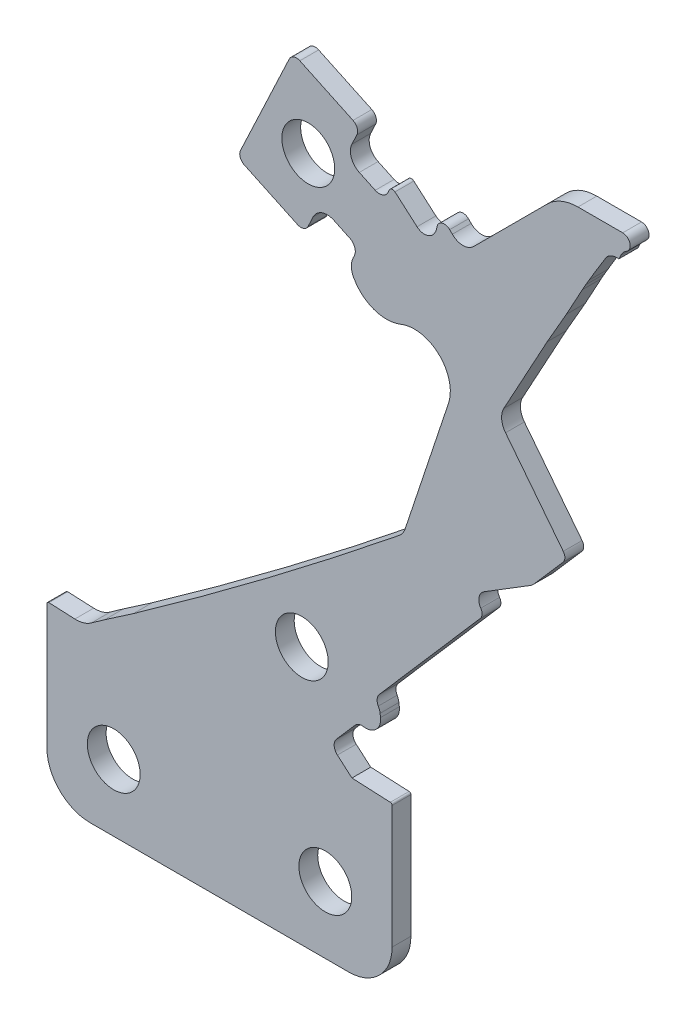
ISO-10303-21;
HEADER;
FILE_DESCRIPTION(('STEP AP214'),'2;1');
FILE_NAME('part.step','',(''),(''),'','','');
FILE_SCHEMA(('AUTOMOTIVE_DESIGN { 1 0 10303 214 1 1 1 1 }'));
ENDSEC;
DATA;
#1=APPLICATION_CONTEXT('core data for automotive mechanical design processes');
#2=APPLICATION_PROTOCOL_DEFINITION('international standard','automotive_design',2000,#1);
#3=PRODUCT_CONTEXT('',#1,'mechanical');
#4=PRODUCT('Part','Part','',(#3));
#5=PRODUCT_RELATED_PRODUCT_CATEGORY('part','',(#4));
#6=PRODUCT_DEFINITION_FORMATION('','',#4);
#7=PRODUCT_DEFINITION_CONTEXT('part definition',#1,'design');
#8=PRODUCT_DEFINITION('design','',#6,#7);
#9=PRODUCT_DEFINITION_SHAPE('','',#8);
#10=(LENGTH_UNIT() NAMED_UNIT(*) SI_UNIT(.MILLI.,.METRE.));
#11=(NAMED_UNIT(*) PLANE_ANGLE_UNIT() SI_UNIT($,.RADIAN.));
#12=(NAMED_UNIT(*) SI_UNIT($,.STERADIAN.) SOLID_ANGLE_UNIT());
#13=UNCERTAINTY_MEASURE_WITH_UNIT(LENGTH_MEASURE(1.E-05),#10,'distance_accuracy_value','');
#14=(GEOMETRIC_REPRESENTATION_CONTEXT(3) GLOBAL_UNCERTAINTY_ASSIGNED_CONTEXT((#13)) GLOBAL_UNIT_ASSIGNED_CONTEXT((#10,
#11,#12)) REPRESENTATION_CONTEXT('',''));
#15=CARTESIAN_POINT('',(0.,0.,0.));
#16=DIRECTION('',(0.,0.,1.));
#17=DIRECTION('',(1.,0.,0.));
#18=AXIS2_PLACEMENT_3D('',#15,#16,#17);
#19=CARTESIAN_POINT('',(-358.504124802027,-3.82584754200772,2.54));
#20=DIRECTION('',(0.,0.,-1.));
#21=DIRECTION('',(-1.,0.,0.));
#22=AXIS2_PLACEMENT_3D('',#19,#20,#21);
#23=CYLINDRICAL_SURFACE('',#22,2.09550000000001);
#24=CARTESIAN_POINT('',(-358.504124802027,-3.82584754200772,0.));
#25=DIRECTION('',(0.,0.,-1.));
#26=DIRECTION('',(1.,0.,0.));
#27=AXIS2_PLACEMENT_3D('',#24,#25,#26);
#28=CIRCLE('',#27,2.09550000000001);
#29=CARTESIAN_POINT('',(-359.39632218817,-5.7219235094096,0.));
#30=VERTEX_POINT('',#29);
#31=CARTESIAN_POINT('',(-360.400200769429,-2.93365015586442,0.));
#32=VERTEX_POINT('',#31);
#33=EDGE_CURVE('E549',#30,#32,#28,.T.);
#34=ORIENTED_EDGE('',*,*,#33,.T.);
#35=DIRECTION('',(0.,0.,-1.));
#36=VECTOR('',#35,1.);
#37=CARTESIAN_POINT('',(-360.400200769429,-2.93365015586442,2.54));
#38=LINE('',#37,#36);
#39=CARTESIAN_POINT('',(-360.400200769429,-2.93365015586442,2.54));
#40=VERTEX_POINT('',#39);
#41=EDGE_CURVE('E11',#40,#32,#38,.T.);
#42=ORIENTED_EDGE('',*,*,#41,.F.);
#43=CARTESIAN_POINT('',(-358.504124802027,-3.82584754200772,2.54));
#44=DIRECTION('',(0.,0.,-1.));
#45=DIRECTION('',(1.,0.,0.));
#46=AXIS2_PLACEMENT_3D('',#43,#44,#45);
#47=CIRCLE('',#46,2.09550000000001);
#48=CARTESIAN_POINT('',(-359.39632218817,-5.7219235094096,2.54));
#49=VERTEX_POINT('',#48);
#50=EDGE_CURVE('E773',#49,#40,#47,.T.);
#51=ORIENTED_EDGE('',*,*,#50,.F.);
#52=DIRECTION('',(0.,0.,-1.));
#53=VECTOR('',#52,1.);
#54=CARTESIAN_POINT('',(-359.39632218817,-5.7219235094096,2.54));
#55=LINE('',#54,#53);
#56=EDGE_CURVE('E545',#49,#30,#55,.T.);
#57=ORIENTED_EDGE('',*,*,#56,.T.);
#58=EDGE_LOOP('',(#34,#42,#51,#57));
#59=FACE_BOUND('',#58,.T.);
#60=ADVANCED_FACE('F45',(#59),#23,.F.);
#61=CARTESIAN_POINT('',(-360.400200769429,-2.93365015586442,2.54));
#62=DIRECTION('',(-0.904832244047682,0.425768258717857,0.));
#63=DIRECTION('',(-0.425768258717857,-0.904832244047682,0.));
#64=AXIS2_PLACEMENT_3D('',#61,#62,#63);
#65=PLANE('',#64);
#66=DIRECTION('',(0.425768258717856,0.904832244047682,0.));
#67=VECTOR('',#66,1.);
#68=CARTESIAN_POINT('',(-360.400200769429,-2.93365015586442,0.));
#69=LINE('',#68,#67);
#70=CARTESIAN_POINT('',(-359.724293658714,-1.49722896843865,0.));
#71=VERTEX_POINT('',#70);
#72=EDGE_CURVE('E553',#32,#71,#69,.T.);
#73=ORIENTED_EDGE('',*,*,#72,.T.);
#74=DIRECTION('',(0.,0.,-1.));
#75=VECTOR('',#74,1.);
#76=CARTESIAN_POINT('',(-359.724293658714,-1.49722896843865,2.54));
#77=LINE('',#76,#75);
#78=CARTESIAN_POINT('',(-359.724293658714,-1.49722896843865,2.54));
#79=VERTEX_POINT('',#78);
#80=EDGE_CURVE('E54',#79,#71,#77,.T.);
#81=ORIENTED_EDGE('',*,*,#80,.F.);
#82=DIRECTION('',(0.425768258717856,0.904832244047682,0.));
#83=VECTOR('',#82,1.);
#84=CARTESIAN_POINT('',(-360.400200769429,-2.93365015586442,2.54));
#85=LINE('',#84,#83);
#86=EDGE_CURVE('E306',#40,#79,#85,.T.);
#87=ORIENTED_EDGE('',*,*,#86,.F.);
#88=ORIENTED_EDGE('',*,*,#41,.T.);
#89=EDGE_LOOP('',(#73,#81,#87,#88));
#90=FACE_BOUND('',#89,.T.);
#91=ADVANCED_FACE('F1379',(#90),#65,.F.);
#92=CARTESIAN_POINT('',(-360.701060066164,-1.03761213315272,2.54));
#93=DIRECTION('',(0.,0.,-1.));
#94=DIRECTION('',(-1.,0.,0.));
#95=AXIS2_PLACEMENT_3D('',#92,#93,#94);
#96=CYLINDRICAL_SURFACE('',#95,1.07949999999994);
#97=CARTESIAN_POINT('',(-360.701060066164,-1.03761213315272,0.));
#98=DIRECTION('',(0.,0.,1.));
#99=DIRECTION('',(1.,0.,0.));
#100=AXIS2_PLACEMENT_3D('',#97,#98,#99);
#101=CIRCLE('',#100,1.07949999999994);
#102=CARTESIAN_POINT('',(-360.241443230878,-0.0608457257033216,0.));
#103=VERTEX_POINT('',#102);
#104=EDGE_CURVE('E557',#71,#103,#101,.T.);
#105=ORIENTED_EDGE('',*,*,#104,.T.);
#106=DIRECTION('',(0.,0.,-1.));
#107=VECTOR('',#106,1.);
#108=CARTESIAN_POINT('',(-360.241443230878,-0.0608457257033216,2.54));
#109=LINE('',#108,#107);
#110=CARTESIAN_POINT('',(-360.241443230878,-0.0608457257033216,2.54));
#111=VERTEX_POINT('',#110);
#112=EDGE_CURVE('E1052',#111,#103,#109,.T.);
#113=ORIENTED_EDGE('',*,*,#112,.F.);
#114=CARTESIAN_POINT('',(-360.701060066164,-1.03761213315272,2.54));
#115=DIRECTION('',(0.,0.,1.));
#116=DIRECTION('',(1.,0.,0.));
#117=AXIS2_PLACEMENT_3D('',#114,#115,#116);
#118=CIRCLE('',#117,1.07949999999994);
#119=EDGE_CURVE('E1063',#79,#111,#118,.T.);
#120=ORIENTED_EDGE('',*,*,#119,.F.);
#121=ORIENTED_EDGE('',*,*,#80,.T.);
#122=EDGE_LOOP('',(#105,#113,#120,#121));
#123=FACE_BOUND('',#122,.T.);
#124=ADVANCED_FACE('F1061',(#123),#96,.T.);
#125=CARTESIAN_POINT('',(-360.241443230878,-0.0608457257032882,2.54));
#126=DIRECTION('',(-0.425768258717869,-0.904832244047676,0.));
#127=DIRECTION('',(0.904832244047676,-0.425768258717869,0.));
#128=AXIS2_PLACEMENT_3D('',#125,#126,#127);
#129=PLANE('',#128);
#130=DIRECTION('',(-0.904832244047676,0.425768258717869,0.));
#131=VECTOR('',#130,1.);
#132=CARTESIAN_POINT('',(-360.241443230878,-0.0608457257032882,0.));
#133=LINE('',#132,#131);
#134=CARTESIAN_POINT('',(-367.423549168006,3.31868982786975,0.));
#135=VERTEX_POINT('',#134);
#136=EDGE_CURVE('E560',#103,#135,#133,.T.);
#137=ORIENTED_EDGE('',*,*,#136,.T.);
#138=DIRECTION('',(0.,0.,-1.));
#139=VECTOR('',#138,1.);
#140=CARTESIAN_POINT('',(-367.423549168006,3.31868982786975,2.54));
#141=LINE('',#140,#139);
#142=CARTESIAN_POINT('',(-367.423549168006,3.31868982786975,2.54));
#143=VERTEX_POINT('',#142);
#144=EDGE_CURVE('E1048',#143,#135,#141,.T.);
#145=ORIENTED_EDGE('',*,*,#144,.F.);
#146=DIRECTION('',(-0.904832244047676,0.425768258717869,0.));
#147=VECTOR('',#146,1.);
#148=CARTESIAN_POINT('',(-360.241443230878,-0.0608457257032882,2.54));
#149=LINE('',#148,#147);
#150=EDGE_CURVE('E1082',#111,#143,#149,.T.);
#151=ORIENTED_EDGE('',*,*,#150,.F.);
#152=ORIENTED_EDGE('',*,*,#112,.T.);
#153=EDGE_LOOP('',(#137,#145,#151,#152));
#154=FACE_BOUND('',#153,.T.);
#155=ADVANCED_FACE('F1072',(#154),#129,.F.);
#156=CARTESIAN_POINT('',(-367.883166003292,2.34192342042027,2.54));
#157=DIRECTION('',(0.,0.,-1.));
#158=DIRECTION('',(-1.,0.,0.));
#159=AXIS2_PLACEMENT_3D('',#156,#157,#158);
#160=CYLINDRICAL_SURFACE('',#159,1.07950000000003);
#161=CARTESIAN_POINT('',(-367.883166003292,2.34192342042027,0.));
#162=DIRECTION('',(0.,0.,1.));
#163=DIRECTION('',(1.,0.,0.));
#164=AXIS2_PLACEMENT_3D('',#161,#162,#163);
#165=CIRCLE('',#164,1.07950000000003);
#166=CARTESIAN_POINT('',(-368.859932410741,2.80154025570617,0.));
#167=VERTEX_POINT('',#166);
#168=EDGE_CURVE('E563',#135,#167,#165,.T.);
#169=ORIENTED_EDGE('',*,*,#168,.T.);
#170=DIRECTION('',(0.,0.,-1.));
#171=VECTOR('',#170,1.);
#172=CARTESIAN_POINT('',(-368.859932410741,2.80154025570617,2.54));
#173=LINE('',#172,#171);
#174=CARTESIAN_POINT('',(-368.859932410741,2.80154025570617,2.54));
#175=VERTEX_POINT('',#174);
#176=EDGE_CURVE('E1044',#175,#167,#173,.T.);
#177=ORIENTED_EDGE('',*,*,#176,.F.);
#178=CARTESIAN_POINT('',(-367.883166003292,2.34192342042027,2.54));
#179=DIRECTION('',(0.,0.,1.));
#180=DIRECTION('',(1.,0.,0.));
#181=AXIS2_PLACEMENT_3D('',#178,#179,#180);
#182=CIRCLE('',#181,1.07950000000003);
#183=EDGE_CURVE('E1078',#143,#175,#182,.T.);
#184=ORIENTED_EDGE('',*,*,#183,.F.);
#185=ORIENTED_EDGE('',*,*,#144,.T.);
#186=EDGE_LOOP('',(#169,#177,#184,#185));
#187=FACE_BOUND('',#186,.T.);
#188=ADVANCED_FACE('F1076',(#187),#160,.T.);
#189=CARTESIAN_POINT('',(-368.859932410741,2.80154025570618,2.54));
#190=DIRECTION('',(0.90483224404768,-0.425768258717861,0.));
#191=DIRECTION('',(0.425768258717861,0.90483224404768,0.));
#192=AXIS2_PLACEMENT_3D('',#189,#190,#191);
#193=PLANE('',#192);
#194=DIRECTION('',(-0.425768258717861,-0.90483224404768,0.));
#195=VECTOR('',#194,1.);
#196=CARTESIAN_POINT('',(-368.859932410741,2.80154025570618,0.));
#197=LINE('',#196,#195);
#198=CARTESIAN_POINT('',(-375.437887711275,-11.1777687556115,0.));
#199=VERTEX_POINT('',#198);
#200=EDGE_CURVE('E566',#167,#199,#197,.T.);
#201=ORIENTED_EDGE('',*,*,#200,.T.);
#202=DIRECTION('',(0.,0.,-1.));
#203=VECTOR('',#202,1.);
#204=CARTESIAN_POINT('',(-375.437887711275,-11.1777687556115,2.54));
#205=LINE('',#204,#203);
#206=CARTESIAN_POINT('',(-375.437887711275,-11.1777687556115,2.54));
#207=VERTEX_POINT('',#206);
#208=EDGE_CURVE('E1040',#207,#199,#205,.T.);
#209=ORIENTED_EDGE('',*,*,#208,.F.);
#210=DIRECTION('',(-0.425768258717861,-0.90483224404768,0.));
#211=VECTOR('',#210,1.);
#212=CARTESIAN_POINT('',(-368.859932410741,2.80154025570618,2.54));
#213=LINE('',#212,#211);
#214=EDGE_CURVE('E1081',#175,#207,#213,.T.);
#215=ORIENTED_EDGE('',*,*,#214,.F.);
#216=ORIENTED_EDGE('',*,*,#176,.T.);
#217=EDGE_LOOP('',(#201,#209,#215,#216));
#218=FACE_BOUND('',#217,.T.);
#219=ADVANCED_FACE('F1392',(#218),#193,.F.);
#220=CARTESIAN_POINT('',(-374.461121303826,-11.6373855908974,2.54));
#221=DIRECTION('',(0.,0.,-1.));
#222=DIRECTION('',(-1.,0.,0.));
#223=AXIS2_PLACEMENT_3D('',#220,#221,#222);
#224=CYLINDRICAL_SURFACE('',#223,1.07950000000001);
#225=CARTESIAN_POINT('',(-374.461121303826,-11.6373855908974,0.));
#226=DIRECTION('',(0.,0.,1.));
#227=DIRECTION('',(1.,0.,0.));
#228=AXIS2_PLACEMENT_3D('',#225,#226,#227);
#229=CIRCLE('',#228,1.07950000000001);
#230=CARTESIAN_POINT('',(-374.920738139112,-12.6141519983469,0.));
#231=VERTEX_POINT('',#230);
#232=EDGE_CURVE('E569',#199,#231,#229,.T.);
#233=ORIENTED_EDGE('',*,*,#232,.T.);
#234=DIRECTION('',(0.,0.,-1.));
#235=VECTOR('',#234,1.);
#236=CARTESIAN_POINT('',(-374.920738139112,-12.6141519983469,2.54));
#237=LINE('',#236,#235);
#238=CARTESIAN_POINT('',(-374.920738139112,-12.6141519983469,2.54));
#239=VERTEX_POINT('',#238);
#240=EDGE_CURVE('E1036',#239,#231,#237,.T.);
#241=ORIENTED_EDGE('',*,*,#240,.F.);
#242=CARTESIAN_POINT('',(-374.461121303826,-11.6373855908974,2.54));
#243=DIRECTION('',(0.,0.,1.));
#244=DIRECTION('',(1.,0.,0.));
#245=AXIS2_PLACEMENT_3D('',#242,#243,#244);
#246=CIRCLE('',#245,1.07950000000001);
#247=EDGE_CURVE('E1087',#207,#239,#246,.T.);
#248=ORIENTED_EDGE('',*,*,#247,.F.);
#249=ORIENTED_EDGE('',*,*,#208,.T.);
#250=EDGE_LOOP('',(#233,#241,#248,#249));
#251=FACE_BOUND('',#250,.T.);
#252=ADVANCED_FACE('F1395',(#251),#224,.T.);
#253=CARTESIAN_POINT('',(-374.920738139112,-12.6141519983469,2.54));
#254=DIRECTION('',(0.42576825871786,0.904832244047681,0.));
#255=DIRECTION('',(-0.904832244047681,0.42576825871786,0.));
#256=AXIS2_PLACEMENT_3D('',#253,#254,#255);
#257=PLANE('',#256);
#258=DIRECTION('',(0.904832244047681,-0.42576825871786,0.));
#259=VECTOR('',#258,1.);
#260=CARTESIAN_POINT('',(-374.920738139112,-12.6141519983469,0.));
#261=LINE('',#260,#259);
#262=CARTESIAN_POINT('',(-367.738632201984,-15.9936875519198,0.));
#263=VERTEX_POINT('',#262);
#264=EDGE_CURVE('E572',#231,#263,#261,.T.);
#265=ORIENTED_EDGE('',*,*,#264,.T.);
#266=DIRECTION('',(0.,0.,-1.));
#267=VECTOR('',#266,1.);
#268=CARTESIAN_POINT('',(-367.738632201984,-15.9936875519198,2.54));
#269=LINE('',#268,#267);
#270=CARTESIAN_POINT('',(-367.738632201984,-15.9936875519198,2.54));
#271=VERTEX_POINT('',#270);
#272=EDGE_CURVE('E1032',#271,#263,#269,.T.);
#273=ORIENTED_EDGE('',*,*,#272,.F.);
#274=DIRECTION('',(0.904832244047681,-0.42576825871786,0.));
#275=VECTOR('',#274,1.);
#276=CARTESIAN_POINT('',(-374.920738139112,-12.6141519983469,2.54));
#277=LINE('',#276,#275);
#278=EDGE_CURVE('E1094',#239,#271,#277,.T.);
#279=ORIENTED_EDGE('',*,*,#278,.F.);
#280=ORIENTED_EDGE('',*,*,#240,.T.);
#281=EDGE_LOOP('',(#265,#273,#279,#280));
#282=FACE_BOUND('',#281,.T.);
#283=ADVANCED_FACE('F1399',(#282),#257,.F.);
#284=CARTESIAN_POINT('',(-367.279015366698,-15.0169211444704,2.54));
#285=DIRECTION('',(0.,0.,-1.));
#286=DIRECTION('',(-1.,0.,0.));
#287=AXIS2_PLACEMENT_3D('',#284,#285,#286);
#288=CYLINDRICAL_SURFACE('',#287,1.07949999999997);
#289=CARTESIAN_POINT('',(-367.279015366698,-15.0169211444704,0.));
#290=DIRECTION('',(0.,0.,1.));
#291=DIRECTION('',(1.,0.,0.));
#292=AXIS2_PLACEMENT_3D('',#289,#290,#291);
#293=CIRCLE('',#292,1.07949999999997);
#294=CARTESIAN_POINT('',(-366.302248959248,-15.4765379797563,0.));
#295=VERTEX_POINT('',#294);
#296=EDGE_CURVE('E575',#263,#295,#293,.T.);
#297=ORIENTED_EDGE('',*,*,#296,.T.);
#298=DIRECTION('',(0.,0.,-1.));
#299=VECTOR('',#298,1.);
#300=CARTESIAN_POINT('',(-366.302248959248,-15.4765379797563,2.54));
#301=LINE('',#300,#299);
#302=CARTESIAN_POINT('',(-366.302248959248,-15.4765379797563,2.54));
#303=VERTEX_POINT('',#302);
#304=EDGE_CURVE('E1028',#303,#295,#301,.T.);
#305=ORIENTED_EDGE('',*,*,#304,.F.);
#306=CARTESIAN_POINT('',(-367.279015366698,-15.0169211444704,2.54));
#307=DIRECTION('',(0.,0.,1.));
#308=DIRECTION('',(1.,0.,0.));
#309=AXIS2_PLACEMENT_3D('',#306,#307,#308);
#310=CIRCLE('',#309,1.07949999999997);
#311=EDGE_CURVE('E1097',#271,#303,#310,.T.);
#312=ORIENTED_EDGE('',*,*,#311,.F.);
#313=ORIENTED_EDGE('',*,*,#272,.T.);
#314=EDGE_LOOP('',(#297,#305,#312,#313));
#315=FACE_BOUND('',#314,.T.);
#316=ADVANCED_FACE('F1403',(#315),#288,.T.);
#317=CARTESIAN_POINT('',(-366.302248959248,-15.4765379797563,2.54));
#318=DIRECTION('',(-0.904832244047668,0.425768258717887,0.));
#319=DIRECTION('',(-0.425768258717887,-0.904832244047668,0.));
#320=AXIS2_PLACEMENT_3D('',#317,#318,#319);
#321=PLANE('',#320);
#322=DIRECTION('',(0.425768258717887,0.904832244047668,0.));
#323=VECTOR('',#322,1.);
#324=CARTESIAN_POINT('',(-366.302248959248,-15.4765379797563,0.));
#325=LINE('',#324,#323);
#326=CARTESIAN_POINT('',(-365.626341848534,-14.0401167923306,0.));
#327=VERTEX_POINT('',#326);
#328=EDGE_CURVE('E578',#295,#327,#325,.T.);
#329=ORIENTED_EDGE('',*,*,#328,.T.);
#330=DIRECTION('',(0.,0.,-1.));
#331=VECTOR('',#330,1.);
#332=CARTESIAN_POINT('',(-365.626341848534,-14.0401167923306,2.54));
#333=LINE('',#332,#331);
#334=CARTESIAN_POINT('',(-365.626341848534,-14.0401167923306,2.54));
#335=VERTEX_POINT('',#334);
#336=EDGE_CURVE('E1024',#335,#327,#333,.T.);
#337=ORIENTED_EDGE('',*,*,#336,.F.);
#338=DIRECTION('',(0.425768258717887,0.904832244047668,0.));
#339=VECTOR('',#338,1.);
#340=CARTESIAN_POINT('',(-366.302248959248,-15.4765379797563,2.54));
#341=LINE('',#340,#339);
#342=EDGE_CURVE('E1100',#303,#335,#341,.T.);
#343=ORIENTED_EDGE('',*,*,#342,.F.);
#344=ORIENTED_EDGE('',*,*,#304,.T.);
#345=EDGE_LOOP('',(#329,#337,#343,#344));
#346=FACE_BOUND('',#345,.T.);
#347=ADVANCED_FACE('F1407',(#346),#321,.F.);
#348=CARTESIAN_POINT('',(-363.730265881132,-14.9323141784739,2.54));
#349=DIRECTION('',(0.,0.,-1.));
#350=DIRECTION('',(-1.,0.,0.));
#351=AXIS2_PLACEMENT_3D('',#348,#349,#350);
#352=CYLINDRICAL_SURFACE('',#351,2.0955);
#353=CARTESIAN_POINT('',(-363.730265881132,-14.9323141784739,0.));
#354=DIRECTION('',(0.,0.,-1.));
#355=DIRECTION('',(1.,0.,0.));
#356=AXIS2_PLACEMENT_3D('',#353,#354,#355);
#357=CIRCLE('',#356,2.0955);
#358=CARTESIAN_POINT('',(-362.838068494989,-13.0362382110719,0.));
#359=VERTEX_POINT('',#358);
#360=EDGE_CURVE('E581',#327,#359,#357,.T.);
#361=ORIENTED_EDGE('',*,*,#360,.T.);
#362=DIRECTION('',(0.,0.,-1.));
#363=VECTOR('',#362,1.);
#364=CARTESIAN_POINT('',(-362.838068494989,-13.0362382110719,2.54));
#365=LINE('',#364,#363);
#366=CARTESIAN_POINT('',(-362.838068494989,-13.0362382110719,2.54));
#367=VERTEX_POINT('',#366);
#368=EDGE_CURVE('E1020',#367,#359,#365,.T.);
#369=ORIENTED_EDGE('',*,*,#368,.F.);
#370=CARTESIAN_POINT('',(-363.730265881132,-14.9323141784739,2.54));
#371=DIRECTION('',(0.,0.,-1.));
#372=DIRECTION('',(1.,0.,0.));
#373=AXIS2_PLACEMENT_3D('',#370,#371,#372);
#374=CIRCLE('',#373,2.0955);
#375=EDGE_CURVE('E1103',#335,#367,#374,.T.);
#376=ORIENTED_EDGE('',*,*,#375,.F.);
#377=ORIENTED_EDGE('',*,*,#336,.T.);
#378=EDGE_LOOP('',(#361,#369,#376,#377));
#379=FACE_BOUND('',#378,.T.);
#380=ADVANCED_FACE('F1411',(#379),#352,.F.);
#381=CARTESIAN_POINT('',(-362.838068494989,-13.0362382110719,2.54));
#382=DIRECTION('',(0.42576825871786,0.90483224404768,0.));
#383=DIRECTION('',(-0.90483224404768,0.42576825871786,0.));
#384=AXIS2_PLACEMENT_3D('',#381,#382,#383);
#385=PLANE('',#384);
#386=DIRECTION('',(0.904832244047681,-0.42576825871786,0.));
#387=VECTOR('',#386,1.);
#388=CARTESIAN_POINT('',(-362.838068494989,-13.0362382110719,0.));
#389=LINE('',#388,#387);
#390=CARTESIAN_POINT('',(-360.68343671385,-14.0500988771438,0.));
#391=VERTEX_POINT('',#390);
#392=EDGE_CURVE('E584',#359,#391,#389,.T.);
#393=ORIENTED_EDGE('',*,*,#392,.T.);
#394=DIRECTION('',(0.,0.,-1.));
#395=VECTOR('',#394,1.);
#396=CARTESIAN_POINT('',(-360.68343671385,-14.0500988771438,2.54));
#397=LINE('',#396,#395);
#398=CARTESIAN_POINT('',(-360.68343671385,-14.0500988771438,2.54));
#399=VERTEX_POINT('',#398);
#400=EDGE_CURVE('E1016',#399,#391,#397,.T.);
#401=ORIENTED_EDGE('',*,*,#400,.F.);
#402=DIRECTION('',(0.904832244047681,-0.42576825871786,0.));
#403=VECTOR('',#402,1.);
#404=CARTESIAN_POINT('',(-362.838068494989,-13.0362382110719,2.54));
#405=LINE('',#404,#403);
#406=EDGE_CURVE('E1106',#367,#399,#405,.T.);
#407=ORIENTED_EDGE('',*,*,#406,.F.);
#408=ORIENTED_EDGE('',*,*,#368,.T.);
#409=EDGE_LOOP('',(#393,#401,#407,#408));
#410=FACE_BOUND('',#409,.T.);
#411=ADVANCED_FACE('F1415',(#410),#385,.F.);
#412=CARTESIAN_POINT('',(-361.237680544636,-15.2279642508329,2.54));
#413=DIRECTION('',(0.,0.,-1.));
#414=DIRECTION('',(-1.,0.,0.));
#415=AXIS2_PLACEMENT_3D('',#412,#413,#414);
#416=CYLINDRICAL_SURFACE('',#415,1.30174999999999);
#417=CARTESIAN_POINT('',(-361.237680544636,-15.2279642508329,0.));
#418=DIRECTION('',(0.,0.,-1.));
#419=DIRECTION('',(1.,0.,0.));
#420=AXIS2_PLACEMENT_3D('',#417,#418,#419);
#421=CIRCLE('',#420,1.30174999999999);
#422=CARTESIAN_POINT('',(-360.059815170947,-15.7822080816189,0.));
#423=VERTEX_POINT('',#422);
#424=EDGE_CURVE('E587',#391,#423,#421,.T.);
#425=ORIENTED_EDGE('',*,*,#424,.T.);
#426=DIRECTION('',(0.,0.,-1.));
#427=VECTOR('',#426,1.);
#428=CARTESIAN_POINT('',(-360.059815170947,-15.7822080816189,2.54));
#429=LINE('',#428,#427);
#430=CARTESIAN_POINT('',(-360.059815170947,-15.7822080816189,2.54));
#431=VERTEX_POINT('',#430);
#432=EDGE_CURVE('E1012',#431,#423,#429,.T.);
#433=ORIENTED_EDGE('',*,*,#432,.F.);
#434=CARTESIAN_POINT('',(-361.237680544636,-15.2279642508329,2.54));
#435=DIRECTION('',(0.,0.,-1.));
#436=DIRECTION('',(1.,0.,0.));
#437=AXIS2_PLACEMENT_3D('',#434,#435,#436);
#438=CIRCLE('',#437,1.30174999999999);
#439=EDGE_CURVE('E1109',#399,#431,#438,.T.);
#440=ORIENTED_EDGE('',*,*,#439,.F.);
#441=ORIENTED_EDGE('',*,*,#400,.T.);
#442=EDGE_LOOP('',(#425,#433,#440,#441));
#443=FACE_BOUND('',#442,.T.);
#444=ADVANCED_FACE('F1419',(#443),#416,.F.);
#445=CARTESIAN_POINT('',(-360.059815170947,-15.7822080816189,2.54));
#446=DIRECTION('',(0.904832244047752,-0.425768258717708,0.));
#447=DIRECTION('',(0.425768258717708,0.904832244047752,0.));
#448=AXIS2_PLACEMENT_3D('',#445,#446,#447);
#449=PLANE('',#448);
#450=DIRECTION('',(-0.425768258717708,-0.904832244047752,0.));
#451=VECTOR('',#450,1.);
#452=CARTESIAN_POINT('',(-360.059815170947,-15.7822080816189,0.));
#453=LINE('',#452,#451);
#454=CARTESIAN_POINT('',(-360.228791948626,-16.1413133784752,0.));
#455=VERTEX_POINT('',#454);
#456=EDGE_CURVE('E590',#423,#455,#453,.T.);
#457=ORIENTED_EDGE('',*,*,#456,.T.);
#458=DIRECTION('',(0.,0.,-1.));
#459=VECTOR('',#458,1.);
#460=CARTESIAN_POINT('',(-360.228791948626,-16.1413133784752,2.54));
#461=LINE('',#460,#459);
#462=CARTESIAN_POINT('',(-360.228791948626,-16.1413133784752,2.54));
#463=VERTEX_POINT('',#462);
#464=EDGE_CURVE('E1008',#463,#455,#461,.T.);
#465=ORIENTED_EDGE('',*,*,#464,.F.);
#466=DIRECTION('',(-0.425768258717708,-0.904832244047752,0.));
#467=VECTOR('',#466,1.);
#468=CARTESIAN_POINT('',(-360.059815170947,-15.7822080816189,2.54));
#469=LINE('',#468,#467);
#470=EDGE_CURVE('E1112',#431,#463,#469,.T.);
#471=ORIENTED_EDGE('',*,*,#470,.F.);
#472=ORIENTED_EDGE('',*,*,#432,.T.);
#473=EDGE_LOOP('',(#457,#465,#471,#472));
#474=FACE_BOUND('',#473,.T.);
#475=ADVANCED_FACE('F1423',(#474),#449,.F.);
#476=CARTESIAN_POINT('',(-357.977308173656,-17.2007476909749,2.54));
#477=DIRECTION('',(0.,0.,-1.));
#478=DIRECTION('',(-1.,0.,0.));
#479=AXIS2_PLACEMENT_3D('',#476,#477,#478);
#480=CYLINDRICAL_SURFACE('',#479,2.48828861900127);
#481=CARTESIAN_POINT('',(-357.977308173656,-17.2007476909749,0.));
#482=DIRECTION('',(0.,0.,1.));
#483=DIRECTION('',(1.,0.,0.));
#484=AXIS2_PLACEMENT_3D('',#481,#482,#483);
#485=CIRCLE('',#484,2.48828861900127);
#486=CARTESIAN_POINT('',(-360.176736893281,-18.3644029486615,0.));
#487=VERTEX_POINT('',#486);
#488=EDGE_CURVE('E593',#455,#487,#485,.T.);
#489=ORIENTED_EDGE('',*,*,#488,.T.);
#490=DIRECTION('',(0.,0.,-1.));
#491=VECTOR('',#490,1.);
#492=CARTESIAN_POINT('',(-360.176736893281,-18.3644029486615,2.54));
#493=LINE('',#492,#491);
#494=CARTESIAN_POINT('',(-360.176736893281,-18.3644029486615,2.54));
#495=VERTEX_POINT('',#494);
#496=EDGE_CURVE('E1004',#495,#487,#493,.T.);
#497=ORIENTED_EDGE('',*,*,#496,.F.);
#498=CARTESIAN_POINT('',(-357.977308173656,-17.2007476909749,2.54));
#499=DIRECTION('',(0.,0.,1.));
#500=DIRECTION('',(1.,0.,0.));
#501=AXIS2_PLACEMENT_3D('',#498,#499,#500);
#502=CIRCLE('',#501,2.48828861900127);
#503=EDGE_CURVE('E1115',#463,#495,#502,.T.);
#504=ORIENTED_EDGE('',*,*,#503,.F.);
#505=ORIENTED_EDGE('',*,*,#464,.T.);
#506=EDGE_LOOP('',(#489,#497,#504,#505));
#507=FACE_BOUND('',#506,.T.);
#508=ADVANCED_FACE('F1427',(#507),#480,.T.);
#509=CARTESIAN_POINT('',(-355.705949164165,-15.9990361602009,2.54));
#510=DIRECTION('',(0.,0.,-1.));
#511=DIRECTION('',(-1.,0.,0.));
#512=AXIS2_PLACEMENT_3D('',#509,#510,#511);
#513=CYLINDRICAL_SURFACE('',#512,5.057954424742);
#514=CARTESIAN_POINT('',(-355.705949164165,-15.9990361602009,0.));
#515=DIRECTION('',(0.,0.,1.));
#516=DIRECTION('',(1.,0.,0.));
#517=AXIS2_PLACEMENT_3D('',#514,#515,#516);
#518=CIRCLE('',#517,5.057954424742);
#519=CARTESIAN_POINT('',(-353.795721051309,-20.6824037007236,0.));
#520=VERTEX_POINT('',#519);
#521=EDGE_CURVE('E596',#487,#520,#518,.T.);
#522=ORIENTED_EDGE('',*,*,#521,.T.);
#523=DIRECTION('',(0.,0.,-1.));
#524=VECTOR('',#523,1.);
#525=CARTESIAN_POINT('',(-353.795721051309,-20.6824037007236,2.54));
#526=LINE('',#525,#524);
#527=CARTESIAN_POINT('',(-353.795721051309,-20.6824037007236,2.54));
#528=VERTEX_POINT('',#527);
#529=EDGE_CURVE('E1000',#528,#520,#526,.T.);
#530=ORIENTED_EDGE('',*,*,#529,.F.);
#531=CARTESIAN_POINT('',(-355.705949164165,-15.9990361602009,2.54));
#532=DIRECTION('',(0.,0.,1.));
#533=DIRECTION('',(1.,0.,0.));
#534=AXIS2_PLACEMENT_3D('',#531,#532,#533);
#535=CIRCLE('',#534,5.057954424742);
#536=EDGE_CURVE('E1118',#495,#528,#535,.T.);
#537=ORIENTED_EDGE('',*,*,#536,.F.);
#538=ORIENTED_EDGE('',*,*,#496,.T.);
#539=EDGE_LOOP('',(#522,#530,#537,#538));
#540=FACE_BOUND('',#539,.T.);
#541=ADVANCED_FACE('F1431',(#540),#513,.T.);
#542=CARTESIAN_POINT('',(-351.961009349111,-25.1806252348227,2.54));
#543=DIRECTION('',(0.,0.,-1.));
#544=DIRECTION('',(-1.,0.,0.));
#545=AXIS2_PLACEMENT_3D('',#542,#543,#544);
#546=CYLINDRICAL_SURFACE('',#545,4.85800000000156);
#547=CARTESIAN_POINT('',(-351.961009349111,-25.1806252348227,0.));
#548=DIRECTION('',(0.,0.,-1.));
#549=DIRECTION('',(1.,0.,0.));
#550=AXIS2_PLACEMENT_3D('',#547,#548,#549);
#551=CIRCLE('',#550,4.85800000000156);
#552=CARTESIAN_POINT('',(-347.351128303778,-26.7133224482,0.));
#553=VERTEX_POINT('',#552);
#554=EDGE_CURVE('E599',#520,#553,#551,.T.);
#555=ORIENTED_EDGE('',*,*,#554,.T.);
#556=DIRECTION('',(0.,0.,-1.));
#557=VECTOR('',#556,1.);
#558=CARTESIAN_POINT('',(-347.351128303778,-26.7133224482,2.54));
#559=LINE('',#558,#557);
#560=CARTESIAN_POINT('',(-347.351128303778,-26.7133224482,2.54));
#561=VERTEX_POINT('',#560);
#562=EDGE_CURVE('E996',#561,#553,#559,.T.);
#563=ORIENTED_EDGE('',*,*,#562,.F.);
#564=CARTESIAN_POINT('',(-351.961009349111,-25.1806252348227,2.54));
#565=DIRECTION('',(0.,0.,-1.));
#566=DIRECTION('',(1.,0.,0.));
#567=AXIS2_PLACEMENT_3D('',#564,#565,#566);
#568=CIRCLE('',#567,4.85800000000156);
#569=EDGE_CURVE('E1121',#528,#561,#568,.T.);
#570=ORIENTED_EDGE('',*,*,#569,.F.);
#571=ORIENTED_EDGE('',*,*,#529,.T.);
#572=EDGE_LOOP('',(#555,#563,#570,#571));
#573=FACE_BOUND('',#572,.T.);
#574=ADVANCED_FACE('F1435',(#573),#546,.F.);
#575=CARTESIAN_POINT('',(-347.351128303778,-26.7133224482,2.54));
#576=DIRECTION('',(0.948925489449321,-0.315500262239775,0.));
#577=DIRECTION('',(0.315500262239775,0.948925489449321,0.));
#578=AXIS2_PLACEMENT_3D('',#575,#576,#577);
#579=PLANE('',#578);
#580=DIRECTION('',(-0.315500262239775,-0.948925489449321,0.));
#581=VECTOR('',#580,1.);
#582=CARTESIAN_POINT('',(-347.351128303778,-26.7133224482,0.));
#583=LINE('',#582,#581);
#584=CARTESIAN_POINT('',(-353.205839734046,-44.3224517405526,0.));
#585=VERTEX_POINT('',#584);
#586=EDGE_CURVE('E602',#553,#585,#583,.T.);
#587=ORIENTED_EDGE('',*,*,#586,.T.);
#588=DIRECTION('',(0.,0.,-1.));
#589=VECTOR('',#588,1.);
#590=CARTESIAN_POINT('',(-353.205839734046,-44.3224517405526,2.54));
#591=LINE('',#590,#589);
#592=CARTESIAN_POINT('',(-353.205839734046,-44.3224517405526,2.54));
#593=VERTEX_POINT('',#592);
#594=EDGE_CURVE('E992',#593,#585,#591,.T.);
#595=ORIENTED_EDGE('',*,*,#594,.F.);
#596=DIRECTION('',(-0.315500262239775,-0.948925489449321,0.));
#597=VECTOR('',#596,1.);
#598=CARTESIAN_POINT('',(-347.351128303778,-26.7133224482,2.54));
#599=LINE('',#598,#597);
#600=EDGE_CURVE('E1124',#561,#593,#599,.T.);
#601=ORIENTED_EDGE('',*,*,#600,.F.);
#602=ORIENTED_EDGE('',*,*,#562,.T.);
#603=EDGE_LOOP('',(#587,#595,#601,#602));
#604=FACE_BOUND('',#603,.T.);
#605=ADVANCED_FACE('F1439',(#604),#579,.F.);
#606=CARTESIAN_POINT('',(-355.585744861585,-43.5311770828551,2.54));
#607=DIRECTION('',(0.,0.,-1.));
#608=DIRECTION('',(-1.,0.,0.));
#609=AXIS2_PLACEMENT_3D('',#606,#607,#608);
#610=CYLINDRICAL_SURFACE('',#609,2.50799999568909);
#611=CARTESIAN_POINT('',(-355.585744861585,-43.5311770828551,0.));
#612=DIRECTION('',(0.,0.,-1.));
#613=DIRECTION('',(1.,0.,0.));
#614=AXIS2_PLACEMENT_3D('',#611,#612,#613);
#615=CIRCLE('',#614,2.50799999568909);
#616=CARTESIAN_POINT('',(-354.01145897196,-45.4835315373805,0.));
#617=VERTEX_POINT('',#616);
#618=EDGE_CURVE('E605',#585,#617,#615,.T.);
#619=ORIENTED_EDGE('',*,*,#618,.T.);
#620=DIRECTION('',(0.,0.,-1.));
#621=VECTOR('',#620,1.);
#622=CARTESIAN_POINT('',(-354.01145897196,-45.4835315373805,2.54));
#623=LINE('',#622,#621);
#624=CARTESIAN_POINT('',(-354.01145897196,-45.4835315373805,2.54));
#625=VERTEX_POINT('',#624);
#626=EDGE_CURVE('E988',#625,#617,#623,.T.);
#627=ORIENTED_EDGE('',*,*,#626,.F.);
#628=CARTESIAN_POINT('',(-355.585744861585,-43.5311770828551,2.54));
#629=DIRECTION('',(0.,0.,-1.));
#630=DIRECTION('',(1.,0.,0.));
#631=AXIS2_PLACEMENT_3D('',#628,#629,#630);
#632=CIRCLE('',#631,2.50799999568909);
#633=EDGE_CURVE('E1127',#593,#625,#632,.T.);
#634=ORIENTED_EDGE('',*,*,#633,.F.);
#635=ORIENTED_EDGE('',*,*,#594,.T.);
#636=EDGE_LOOP('',(#619,#627,#634,#635));
#637=FACE_BOUND('',#636,.T.);
#638=ADVANCED_FACE('F1443',(#637),#610,.F.);
#639=CARTESIAN_POINT('',(-793.724322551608,499.827439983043,2.54));
#640=DIRECTION('',(0.,0.,-1.));
#641=DIRECTION('',(-1.,0.,0.));
#642=AXIS2_PLACEMENT_3D('',#639,#640,#641);
#643=CYLINDRICAL_SURFACE('',#642,700.507999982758);
#644=CARTESIAN_POINT('',(-793.724322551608,499.827439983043,0.));
#645=DIRECTION('',(0.,0.,-1.));
#646=DIRECTION('',(1.,0.,0.));
#647=AXIS2_PLACEMENT_3D('',#644,#645,#646);
#648=CIRCLE('',#647,700.507999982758);
#649=CARTESIAN_POINT('',(-389.903017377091,-72.5708579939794,0.));
#650=VERTEX_POINT('',#649);
#651=EDGE_CURVE('E608',#617,#650,#648,.T.);
#652=ORIENTED_EDGE('',*,*,#651,.T.);
#653=DIRECTION('',(0.,0.,-1.));
#654=VECTOR('',#653,1.);
#655=CARTESIAN_POINT('',(-389.903017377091,-72.5708579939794,2.54));
#656=LINE('',#655,#654);
#657=CARTESIAN_POINT('',(-389.903017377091,-72.5708579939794,2.54));
#658=VERTEX_POINT('',#657);
#659=EDGE_CURVE('E984',#658,#650,#656,.T.);
#660=ORIENTED_EDGE('',*,*,#659,.F.);
#661=CARTESIAN_POINT('',(-793.724322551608,499.827439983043,2.54));
#662=DIRECTION('',(0.,0.,-1.));
#663=DIRECTION('',(1.,0.,0.));
#664=AXIS2_PLACEMENT_3D('',#661,#662,#663);
#665=CIRCLE('',#664,700.507999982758);
#666=EDGE_CURVE('E1130',#625,#658,#665,.T.);
#667=ORIENTED_EDGE('',*,*,#666,.F.);
#668=ORIENTED_EDGE('',*,*,#626,.T.);
#669=EDGE_LOOP('',(#652,#660,#667,#668));
#670=FACE_BOUND('',#669,.T.);
#671=ADVANCED_FACE('F1447',(#670),#643,.F.);
#672=CARTESIAN_POINT('',(-389.903017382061,-72.5708579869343,2.54));
#673=DIRECTION('',(0.564728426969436,-0.825276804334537,0.));
#674=DIRECTION('',(0.825276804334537,0.564728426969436,0.));
#675=AXIS2_PLACEMENT_3D('',#672,#673,#674);
#676=PLANE('',#675);
#677=DIRECTION('',(-0.825276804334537,-0.564728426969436,0.));
#678=VECTOR('',#677,1.);
#679=CARTESIAN_POINT('',(-389.903017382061,-72.5708579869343,0.));
#680=LINE('',#679,#678);
#681=CARTESIAN_POINT('',(-393.778847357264,-75.2230485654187,0.));
#682=VERTEX_POINT('',#681);
#683=EDGE_CURVE('E611',#650,#682,#680,.T.);
#684=ORIENTED_EDGE('',*,*,#683,.T.);
#685=DIRECTION('',(0.,0.,-1.));
#686=VECTOR('',#685,1.);
#687=CARTESIAN_POINT('',(-393.778847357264,-75.2230485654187,2.54));
#688=LINE('',#687,#686);
#689=CARTESIAN_POINT('',(-393.778847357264,-75.2230485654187,2.54));
#690=VERTEX_POINT('',#689);
#691=EDGE_CURVE('E980',#690,#682,#688,.T.);
#692=ORIENTED_EDGE('',*,*,#691,.F.);
#693=DIRECTION('',(-0.825276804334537,-0.564728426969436,0.));
#694=VECTOR('',#693,1.);
#695=CARTESIAN_POINT('',(-389.903017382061,-72.5708579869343,2.54));
#696=LINE('',#695,#694);
#697=EDGE_CURVE('E1133',#658,#690,#696,.T.);
#698=ORIENTED_EDGE('',*,*,#697,.F.);
#699=ORIENTED_EDGE('',*,*,#659,.T.);
#700=EDGE_LOOP('',(#684,#692,#698,#699));
#701=FACE_BOUND('',#700,.T.);
#702=ADVANCED_FACE('F1451',(#701),#676,.F.);
#703=CARTESIAN_POINT('',(-95.1890556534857,-497.808611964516,2.54));
#704=DIRECTION('',(0.,0.,-1.));
#705=DIRECTION('',(-1.,0.,0.));
#706=AXIS2_PLACEMENT_3D('',#703,#704,#705);
#707=CYLINDRICAL_SURFACE('',#706,517.430596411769);
#708=CARTESIAN_POINT('',(-95.1890556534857,-497.808611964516,0.));
#709=DIRECTION('',(0.,0.,1.));
#710=DIRECTION('',(1.,0.,0.));
#711=AXIS2_PLACEMENT_3D('',#708,#709,#710);
#712=CIRCLE('',#711,517.430596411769);
#713=CARTESIAN_POINT('',(-395.571337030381,-76.4952996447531,0.));
#714=VERTEX_POINT('',#713);
#715=EDGE_CURVE('E614',#682,#714,#712,.T.);
#716=ORIENTED_EDGE('',*,*,#715,.T.);
#717=DIRECTION('',(0.,0.,-1.));
#718=VECTOR('',#717,1.);
#719=CARTESIAN_POINT('',(-395.571337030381,-76.4952996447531,2.54));
#720=LINE('',#719,#718);
#721=CARTESIAN_POINT('',(-395.571337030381,-76.4952996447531,2.54));
#722=VERTEX_POINT('',#721);
#723=EDGE_CURVE('E976',#722,#714,#720,.T.);
#724=ORIENTED_EDGE('',*,*,#723,.F.);
#725=CARTESIAN_POINT('',(-95.1890556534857,-497.808611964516,2.54));
#726=DIRECTION('',(0.,0.,1.));
#727=DIRECTION('',(1.,0.,0.));
#728=AXIS2_PLACEMENT_3D('',#725,#726,#727);
#729=CIRCLE('',#728,517.430596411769);
#730=EDGE_CURVE('E1136',#690,#722,#729,.T.);
#731=ORIENTED_EDGE('',*,*,#730,.F.);
#732=ORIENTED_EDGE('',*,*,#691,.T.);
#733=EDGE_LOOP('',(#716,#724,#731,#732));
#734=FACE_BOUND('',#733,.T.);
#735=ADVANCED_FACE('F1455',(#734),#707,.T.);
#736=CARTESIAN_POINT('',(-397.635690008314,-73.599857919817,2.54));
#737=DIRECTION('',(0.,0.,-1.));
#738=DIRECTION('',(-1.,0.,0.));
#739=AXIS2_PLACEMENT_3D('',#736,#737,#738);
#740=CYLINDRICAL_SURFACE('',#739,3.55599999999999);
#741=CARTESIAN_POINT('',(-397.635690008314,-73.599857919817,0.));
#742=DIRECTION('',(0.,0.,-1.));
#743=DIRECTION('',(1.,0.,0.));
#744=AXIS2_PLACEMENT_3D('',#741,#742,#743);
#745=CIRCLE('',#744,3.55599999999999);
#746=CARTESIAN_POINT('',(-397.803086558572,-77.1519156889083,0.));
#747=VERTEX_POINT('',#746);
#748=EDGE_CURVE('E617',#714,#747,#745,.T.);
#749=ORIENTED_EDGE('',*,*,#748,.T.);
#750=DIRECTION('',(0.,0.,-1.));
#751=VECTOR('',#750,1.);
#752=CARTESIAN_POINT('',(-397.803086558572,-77.1519156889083,2.54));
#753=LINE('',#752,#751);
#754=CARTESIAN_POINT('',(-397.803086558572,-77.1519156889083,2.54));
#755=VERTEX_POINT('',#754);
#756=EDGE_CURVE('E972',#755,#747,#753,.T.);
#757=ORIENTED_EDGE('',*,*,#756,.F.);
#758=CARTESIAN_POINT('',(-397.635690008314,-73.599857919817,2.54));
#759=DIRECTION('',(0.,0.,-1.));
#760=DIRECTION('',(1.,0.,0.));
#761=AXIS2_PLACEMENT_3D('',#758,#759,#760);
#762=CIRCLE('',#761,3.55599999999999);
#763=EDGE_CURVE('E1139',#722,#755,#762,.T.);
#764=ORIENTED_EDGE('',*,*,#763,.F.);
#765=ORIENTED_EDGE('',*,*,#723,.T.);
#766=EDGE_LOOP('',(#749,#757,#764,#765));
#767=FACE_BOUND('',#766,.T.);
#768=ADVANCED_FACE('F1459',(#767),#740,.F.);
#769=CARTESIAN_POINT('',(-397.803086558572,-77.1519156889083,2.54));
#770=DIRECTION('',(-0.0470743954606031,-0.998891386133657,0.));
#771=DIRECTION('',(0.998891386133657,-0.0470743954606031,0.));
#772=AXIS2_PLACEMENT_3D('',#769,#770,#771);
#773=PLANE('',#772);
#774=DIRECTION('',(-0.998891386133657,0.0470743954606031,0.));
#775=VECTOR('',#774,1.);
#776=CARTESIAN_POINT('',(-397.803086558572,-77.1519156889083,0.));
#777=LINE('',#776,#775);
#778=CARTESIAN_POINT('',(-401.308043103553,-76.986738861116,0.));
#779=VERTEX_POINT('',#778);
#780=EDGE_CURVE('E620',#747,#779,#777,.T.);
#781=ORIENTED_EDGE('',*,*,#780,.T.);
#782=DIRECTION('',(0.,0.,-1.));
#783=VECTOR('',#782,1.);
#784=CARTESIAN_POINT('',(-401.308043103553,-76.986738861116,2.54));
#785=LINE('',#784,#783);
#786=CARTESIAN_POINT('',(-401.308043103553,-76.986738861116,2.54));
#787=VERTEX_POINT('',#786);
#788=EDGE_CURVE('E968',#787,#779,#785,.T.);
#789=ORIENTED_EDGE('',*,*,#788,.F.);
#790=DIRECTION('',(-0.998891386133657,0.0470743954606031,0.));
#791=VECTOR('',#790,1.);
#792=CARTESIAN_POINT('',(-397.803086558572,-77.1519156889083,2.54));
#793=LINE('',#792,#791);
#794=EDGE_CURVE('E1142',#755,#787,#793,.T.);
#795=ORIENTED_EDGE('',*,*,#794,.F.);
#796=ORIENTED_EDGE('',*,*,#756,.T.);
#797=EDGE_LOOP('',(#781,#789,#795,#796));
#798=FACE_BOUND('',#797,.T.);
#799=ADVANCED_FACE('F1463',(#798),#773,.F.);
#800=CARTESIAN_POINT('',(-401.32,-77.240457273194,2.54));
#801=DIRECTION('',(0.,0.,-1.));
#802=DIRECTION('',(-1.,0.,0.));
#803=AXIS2_PLACEMENT_3D('',#800,#801,#802);
#804=CYLINDRICAL_SURFACE('',#803,0.254000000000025);
#805=CARTESIAN_POINT('',(-401.32,-77.240457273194,0.));
#806=DIRECTION('',(0.,0.,1.));
#807=DIRECTION('',(1.,0.,0.));
#808=AXIS2_PLACEMENT_3D('',#805,#806,#807);
#809=CIRCLE('',#808,0.254000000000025);
#810=CARTESIAN_POINT('',(-401.574,-77.240457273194,0.));
#811=VERTEX_POINT('',#810);
#812=EDGE_CURVE('E623',#779,#811,#809,.T.);
#813=ORIENTED_EDGE('',*,*,#812,.T.);
#814=DIRECTION('',(0.,0.,-1.));
#815=VECTOR('',#814,1.);
#816=CARTESIAN_POINT('',(-401.574,-77.240457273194,2.54));
#817=LINE('',#816,#815);
#818=CARTESIAN_POINT('',(-401.574,-77.240457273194,2.54));
#819=VERTEX_POINT('',#818);
#820=EDGE_CURVE('E964',#819,#811,#817,.T.);
#821=ORIENTED_EDGE('',*,*,#820,.F.);
#822=CARTESIAN_POINT('',(-401.32,-77.240457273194,2.54));
#823=DIRECTION('',(0.,0.,1.));
#824=DIRECTION('',(1.,0.,0.));
#825=AXIS2_PLACEMENT_3D('',#822,#823,#824);
#826=CIRCLE('',#825,0.254000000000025);
#827=EDGE_CURVE('E1145',#787,#819,#826,.T.);
#828=ORIENTED_EDGE('',*,*,#827,.F.);
#829=ORIENTED_EDGE('',*,*,#788,.T.);
#830=EDGE_LOOP('',(#813,#821,#828,#829));
#831=FACE_BOUND('',#830,.T.);
#832=ADVANCED_FACE('F1467',(#831),#804,.T.);
#833=CARTESIAN_POINT('',(-401.574,-77.240457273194,2.54));
#834=DIRECTION('',(1.,0.,0.));
#835=DIRECTION('',(0.,0.,-1.));
#836=AXIS2_PLACEMENT_3D('',#833,#834,#835);
#837=PLANE('',#836);
#838=DIRECTION('',(0.,-1.,0.));
#839=VECTOR('',#838,1.);
#840=CARTESIAN_POINT('',(-401.574,-77.240457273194,0.));
#841=LINE('',#840,#839);
#842=CARTESIAN_POINT('',(-401.574,-94.1069999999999,0.));
#843=VERTEX_POINT('',#842);
#844=EDGE_CURVE('E626',#811,#843,#841,.T.);
#845=ORIENTED_EDGE('',*,*,#844,.T.);
#846=DIRECTION('',(0.,0.,-1.));
#847=VECTOR('',#846,1.);
#848=CARTESIAN_POINT('',(-401.574,-94.1069999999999,2.54));
#849=LINE('',#848,#847);
#850=CARTESIAN_POINT('',(-401.574,-94.1069999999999,2.54));
#851=VERTEX_POINT('',#850);
#852=EDGE_CURVE('E960',#851,#843,#849,.T.);
#853=ORIENTED_EDGE('',*,*,#852,.F.);
#854=DIRECTION('',(0.,-1.,0.));
#855=VECTOR('',#854,1.);
#856=CARTESIAN_POINT('',(-401.574,-77.240457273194,2.54));
#857=LINE('',#856,#855);
#858=EDGE_CURVE('E1148',#819,#851,#857,.T.);
#859=ORIENTED_EDGE('',*,*,#858,.F.);
#860=ORIENTED_EDGE('',*,*,#820,.T.);
#861=EDGE_LOOP('',(#845,#853,#859,#860));
#862=FACE_BOUND('',#861,.T.);
#863=ADVANCED_FACE('F1471',(#862),#837,.F.);
#864=CARTESIAN_POINT('',(-395.732,-94.107,2.54));
#865=DIRECTION('',(0.,0.,-1.));
#866=DIRECTION('',(-1.,0.,0.));
#867=AXIS2_PLACEMENT_3D('',#864,#865,#866);
#868=CYLINDRICAL_SURFACE('',#867,5.84200000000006);
#869=CARTESIAN_POINT('',(-395.732,-94.107,0.));
#870=DIRECTION('',(0.,0.,1.));
#871=DIRECTION('',(1.,0.,0.));
#872=AXIS2_PLACEMENT_3D('',#869,#870,#871);
#873=CIRCLE('',#872,5.84200000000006);
#874=CARTESIAN_POINT('',(-395.732,-99.9490000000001,0.));
#875=VERTEX_POINT('',#874);
#876=EDGE_CURVE('E629',#843,#875,#873,.T.);
#877=ORIENTED_EDGE('',*,*,#876,.T.);
#878=DIRECTION('',(0.,0.,-1.));
#879=VECTOR('',#878,1.);
#880=CARTESIAN_POINT('',(-395.732,-99.9490000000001,2.54));
#881=LINE('',#880,#879);
#882=CARTESIAN_POINT('',(-395.732,-99.9490000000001,2.54));
#883=VERTEX_POINT('',#882);
#884=EDGE_CURVE('E956',#883,#875,#881,.T.);
#885=ORIENTED_EDGE('',*,*,#884,.F.);
#886=CARTESIAN_POINT('',(-395.732,-94.107,2.54));
#887=DIRECTION('',(0.,0.,1.));
#888=DIRECTION('',(1.,0.,0.));
#889=AXIS2_PLACEMENT_3D('',#886,#887,#888);
#890=CIRCLE('',#889,5.84200000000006);
#891=EDGE_CURVE('E1151',#851,#883,#890,.T.);
#892=ORIENTED_EDGE('',*,*,#891,.F.);
#893=ORIENTED_EDGE('',*,*,#852,.T.);
#894=EDGE_LOOP('',(#877,#885,#892,#893));
#895=FACE_BOUND('',#894,.T.);
#896=ADVANCED_FACE('F1475',(#895),#868,.T.);
#897=CARTESIAN_POINT('',(-395.732,-99.9490000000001,2.54));
#898=DIRECTION('',(0.,1.,0.));
#899=DIRECTION('',(-1.,0.,0.));
#900=AXIS2_PLACEMENT_3D('',#897,#898,#899);
#901=PLANE('',#900);
#902=DIRECTION('',(1.,0.,0.));
#903=VECTOR('',#902,1.);
#904=CARTESIAN_POINT('',(-395.732,-99.9490000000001,0.));
#905=LINE('',#904,#903);
#906=CARTESIAN_POINT('',(-360.807,-99.9490000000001,0.));
#907=VERTEX_POINT('',#906);
#908=EDGE_CURVE('E632',#875,#907,#905,.T.);
#909=ORIENTED_EDGE('',*,*,#908,.T.);
#910=DIRECTION('',(0.,0.,-1.));
#911=VECTOR('',#910,1.);
#912=CARTESIAN_POINT('',(-360.807,-99.9490000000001,2.54));
#913=LINE('',#912,#911);
#914=CARTESIAN_POINT('',(-360.807,-99.9490000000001,2.54));
#915=VERTEX_POINT('',#914);
#916=EDGE_CURVE('E952',#915,#907,#913,.T.);
#917=ORIENTED_EDGE('',*,*,#916,.F.);
#918=DIRECTION('',(1.,0.,0.));
#919=VECTOR('',#918,1.);
#920=CARTESIAN_POINT('',(-395.732,-99.9490000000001,2.54));
#921=LINE('',#920,#919);
#922=EDGE_CURVE('E1154',#883,#915,#921,.T.);
#923=ORIENTED_EDGE('',*,*,#922,.F.);
#924=ORIENTED_EDGE('',*,*,#884,.T.);
#925=EDGE_LOOP('',(#909,#917,#923,#924));
#926=FACE_BOUND('',#925,.T.);
#927=ADVANCED_FACE('F1479',(#926),#901,.F.);
#928=CARTESIAN_POINT('',(-360.807,-94.107,2.54));
#929=DIRECTION('',(0.,0.,-1.));
#930=DIRECTION('',(-1.,0.,0.));
#931=AXIS2_PLACEMENT_3D('',#928,#929,#930);
#932=CYLINDRICAL_SURFACE('',#931,5.84200000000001);
#933=CARTESIAN_POINT('',(-360.807,-94.107,0.));
#934=DIRECTION('',(0.,0.,1.));
#935=DIRECTION('',(1.,0.,0.));
#936=AXIS2_PLACEMENT_3D('',#933,#934,#935);
#937=CIRCLE('',#936,5.84200000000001);
#938=CARTESIAN_POINT('',(-354.965,-94.107,0.));
#939=VERTEX_POINT('',#938);
#940=EDGE_CURVE('E635',#907,#939,#937,.T.);
#941=ORIENTED_EDGE('',*,*,#940,.T.);
#942=DIRECTION('',(0.,0.,-1.));
#943=VECTOR('',#942,1.);
#944=CARTESIAN_POINT('',(-354.965,-94.107,2.54));
#945=LINE('',#944,#943);
#946=CARTESIAN_POINT('',(-354.965,-94.107,2.54));
#947=VERTEX_POINT('',#946);
#948=EDGE_CURVE('E948',#947,#939,#945,.T.);
#949=ORIENTED_EDGE('',*,*,#948,.F.);
#950=CARTESIAN_POINT('',(-360.807,-94.107,2.54));
#951=DIRECTION('',(0.,0.,1.));
#952=DIRECTION('',(1.,0.,0.));
#953=AXIS2_PLACEMENT_3D('',#950,#951,#952);
#954=CIRCLE('',#953,5.84200000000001);
#955=EDGE_CURVE('E1157',#915,#947,#954,.T.);
#956=ORIENTED_EDGE('',*,*,#955,.F.);
#957=ORIENTED_EDGE('',*,*,#916,.T.);
#958=EDGE_LOOP('',(#941,#949,#956,#957));
#959=FACE_BOUND('',#958,.T.);
#960=ADVANCED_FACE('F1483',(#959),#932,.T.);
#961=CARTESIAN_POINT('',(-354.965,-94.107,2.54));
#962=DIRECTION('',(-1.,0.,0.));
#963=DIRECTION('',(0.,-1.,0.));
#964=AXIS2_PLACEMENT_3D('',#961,#962,#963);
#965=PLANE('',#964);
#966=DIRECTION('',(0.,1.,0.));
#967=VECTOR('',#966,1.);
#968=CARTESIAN_POINT('',(-354.965,-94.107,0.));
#969=LINE('',#968,#967);
#970=CARTESIAN_POINT('',(-354.965,-77.5397114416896,0.));
#971=VERTEX_POINT('',#970);
#972=EDGE_CURVE('E638',#939,#971,#969,.T.);
#973=ORIENTED_EDGE('',*,*,#972,.T.);
#974=DIRECTION('',(0.,0.,-1.));
#975=VECTOR('',#974,1.);
#976=CARTESIAN_POINT('',(-354.965,-77.5397114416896,2.54));
#977=LINE('',#976,#975);
#978=CARTESIAN_POINT('',(-354.965,-77.5397114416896,2.54));
#979=VERTEX_POINT('',#978);
#980=EDGE_CURVE('E944',#979,#971,#977,.T.);
#981=ORIENTED_EDGE('',*,*,#980,.F.);
#982=DIRECTION('',(0.,1.,0.));
#983=VECTOR('',#982,1.);
#984=CARTESIAN_POINT('',(-354.965,-94.107,2.54));
#985=LINE('',#984,#983);
#986=EDGE_CURVE('E1160',#947,#979,#985,.T.);
#987=ORIENTED_EDGE('',*,*,#986,.F.);
#988=ORIENTED_EDGE('',*,*,#948,.T.);
#989=EDGE_LOOP('',(#973,#981,#987,#988));
#990=FACE_BOUND('',#989,.T.);
#991=ADVANCED_FACE('F1487',(#990),#965,.F.);
#992=CARTESIAN_POINT('',(-355.219,-77.5397114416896,2.54));
#993=DIRECTION('',(0.,0.,-1.));
#994=DIRECTION('',(-1.,0.,0.));
#995=AXIS2_PLACEMENT_3D('',#992,#993,#994);
#996=CYLINDRICAL_SURFACE('',#995,0.254000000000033);
#997=CARTESIAN_POINT('',(-355.219,-77.5397114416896,0.));
#998=DIRECTION('',(0.,0.,1.));
#999=DIRECTION('',(1.,0.,0.));
#1000=AXIS2_PLACEMENT_3D('',#997,#998,#999);
#1001=CIRCLE('',#1000,0.254000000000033);
#1002=CARTESIAN_POINT('',(-355.207043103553,-77.2859930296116,0.));
#1003=VERTEX_POINT('',#1002);
#1004=EDGE_CURVE('E641',#971,#1003,#1001,.T.);
#1005=ORIENTED_EDGE('',*,*,#1004,.T.);
#1006=DIRECTION('',(0.,0.,-1.));
#1007=VECTOR('',#1006,1.);
#1008=CARTESIAN_POINT('',(-355.207043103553,-77.2859930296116,2.54));
#1009=LINE('',#1008,#1007);
#1010=CARTESIAN_POINT('',(-355.207043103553,-77.2859930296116,2.54));
#1011=VERTEX_POINT('',#1010);
#1012=EDGE_CURVE('E940',#1011,#1003,#1009,.T.);
#1013=ORIENTED_EDGE('',*,*,#1012,.F.);
#1014=CARTESIAN_POINT('',(-355.219,-77.5397114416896,2.54));
#1015=DIRECTION('',(0.,0.,1.));
#1016=DIRECTION('',(1.,0.,0.));
#1017=AXIS2_PLACEMENT_3D('',#1014,#1015,#1016);
#1018=CIRCLE('',#1017,0.254000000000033);
#1019=EDGE_CURVE('E1163',#979,#1011,#1018,.T.);
#1020=ORIENTED_EDGE('',*,*,#1019,.F.);
#1021=ORIENTED_EDGE('',*,*,#980,.T.);
#1022=EDGE_LOOP('',(#1005,#1013,#1020,#1021));
#1023=FACE_BOUND('',#1022,.T.);
#1024=ADVANCED_FACE('F1491',(#1023),#996,.T.);
#1025=CARTESIAN_POINT('',(-355.207043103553,-77.2859930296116,2.54));
#1026=DIRECTION('',(-0.0470743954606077,-0.998891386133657,0.));
#1027=DIRECTION('',(0.998891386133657,-0.0470743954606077,0.));
#1028=AXIS2_PLACEMENT_3D('',#1025,#1026,#1027);
#1029=PLANE('',#1028);
#1030=DIRECTION('',(-0.998891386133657,0.0470743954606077,0.));
#1031=VECTOR('',#1030,1.);
#1032=CARTESIAN_POINT('',(-355.207043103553,-77.2859930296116,0.));
#1033=LINE('',#1032,#1031);
#1034=CARTESIAN_POINT('',(-360.390031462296,-77.0417361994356,0.));
#1035=VERTEX_POINT('',#1034);
#1036=EDGE_CURVE('E644',#1003,#1035,#1033,.T.);
#1037=ORIENTED_EDGE('',*,*,#1036,.T.);
#1038=DIRECTION('',(0.,0.,-1.));
#1039=VECTOR('',#1038,1.);
#1040=CARTESIAN_POINT('',(-360.390031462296,-77.0417361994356,2.54));
#1041=LINE('',#1040,#1039);
#1042=CARTESIAN_POINT('',(-360.390031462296,-77.0417361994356,2.54));
#1043=VERTEX_POINT('',#1042);
#1044=EDGE_CURVE('E936',#1043,#1035,#1041,.T.);
#1045=ORIENTED_EDGE('',*,*,#1044,.F.);
#1046=DIRECTION('',(-0.998891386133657,0.0470743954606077,0.));
#1047=VECTOR('',#1046,1.);
#1048=CARTESIAN_POINT('',(-355.207043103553,-77.2859930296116,2.54));
#1049=LINE('',#1048,#1047);
#1050=EDGE_CURVE('E1166',#1011,#1043,#1049,.T.);
#1051=ORIENTED_EDGE('',*,*,#1050,.F.);
#1052=ORIENTED_EDGE('',*,*,#1012,.T.);
#1053=EDGE_LOOP('',(#1037,#1045,#1051,#1052));
#1054=FACE_BOUND('',#1053,.T.);
#1055=ADVANCED_FACE('F1495',(#1054),#1029,.F.);
#1056=CARTESIAN_POINT('',(-360.390031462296,-77.0417361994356,2.54));
#1057=DIRECTION('',(-0.655690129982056,-0.755030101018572,0.));
#1058=DIRECTION('',(0.755030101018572,-0.655690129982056,0.));
#1059=AXIS2_PLACEMENT_3D('',#1056,#1057,#1058);
#1060=PLANE('',#1059);
#1061=DIRECTION('',(-0.755030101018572,0.655690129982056,0.));
#1062=VECTOR('',#1061,1.);
#1063=CARTESIAN_POINT('',(-360.390031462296,-77.0417361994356,0.));
#1064=LINE('',#1063,#1062);
#1065=CARTESIAN_POINT('',(-362.352447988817,-75.3375165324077,0.));
#1066=VERTEX_POINT('',#1065);
#1067=EDGE_CURVE('E647',#1035,#1066,#1064,.T.);
#1068=ORIENTED_EDGE('',*,*,#1067,.T.);
#1069=DIRECTION('',(0.,0.,-1.));
#1070=VECTOR('',#1069,1.);
#1071=CARTESIAN_POINT('',(-362.352447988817,-75.3375165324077,2.54));
#1072=LINE('',#1071,#1070);
#1073=CARTESIAN_POINT('',(-362.352447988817,-75.3375165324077,2.54));
#1074=VERTEX_POINT('',#1073);
#1075=EDGE_CURVE('E932',#1074,#1066,#1072,.T.);
#1076=ORIENTED_EDGE('',*,*,#1075,.F.);
#1077=DIRECTION('',(-0.755030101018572,0.655690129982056,0.));
#1078=VECTOR('',#1077,1.);
#1079=CARTESIAN_POINT('',(-360.390031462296,-77.0417361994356,2.54));
#1080=LINE('',#1079,#1078);
#1081=EDGE_CURVE('E1169',#1043,#1074,#1080,.T.);
#1082=ORIENTED_EDGE('',*,*,#1081,.F.);
#1083=ORIENTED_EDGE('',*,*,#1044,.T.);
#1084=EDGE_LOOP('',(#1068,#1076,#1082,#1083));
#1085=FACE_BOUND('',#1084,.T.);
#1086=ADVANCED_FACE('F1499',(#1085),#1060,.F.);
#1087=CARTESIAN_POINT('',(-361.51972152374,-74.3786283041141,2.54));
#1088=DIRECTION('',(0.,0.,-1.));
#1089=DIRECTION('',(-1.,0.,0.));
#1090=AXIS2_PLACEMENT_3D('',#1087,#1088,#1089);
#1091=CYLINDRICAL_SURFACE('',#1090,1.26999999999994);
#1092=CARTESIAN_POINT('',(-361.51972152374,-74.3786283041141,0.));
#1093=DIRECTION('',(0.,0.,-1.));
#1094=DIRECTION('',(1.,0.,0.));
#1095=AXIS2_PLACEMENT_3D('',#1092,#1093,#1094);
#1096=CIRCLE('',#1095,1.26999999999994);
#1097=CARTESIAN_POINT('',(-362.478609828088,-73.5459019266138,0.));
#1098=VERTEX_POINT('',#1097);
#1099=EDGE_CURVE('E650',#1066,#1098,#1096,.T.);
#1100=ORIENTED_EDGE('',*,*,#1099,.T.);
#1101=DIRECTION('',(0.,0.,-1.));
#1102=VECTOR('',#1101,1.);
#1103=CARTESIAN_POINT('',(-362.478609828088,-73.5459019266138,2.54));
#1104=LINE('',#1103,#1102);
#1105=CARTESIAN_POINT('',(-362.478609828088,-73.5459019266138,2.54));
#1106=VERTEX_POINT('',#1105);
#1107=EDGE_CURVE('E928',#1106,#1098,#1104,.T.);
#1108=ORIENTED_EDGE('',*,*,#1107,.F.);
#1109=CARTESIAN_POINT('',(-361.51972152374,-74.3786283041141,2.54));
#1110=DIRECTION('',(0.,0.,-1.));
#1111=DIRECTION('',(1.,0.,0.));
#1112=AXIS2_PLACEMENT_3D('',#1109,#1110,#1111);
#1113=CIRCLE('',#1112,1.26999999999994);
#1114=EDGE_CURVE('E1172',#1074,#1106,#1113,.T.);
#1115=ORIENTED_EDGE('',*,*,#1114,.F.);
#1116=ORIENTED_EDGE('',*,*,#1075,.T.);
#1117=EDGE_LOOP('',(#1100,#1108,#1115,#1116));
#1118=FACE_BOUND('',#1117,.T.);
#1119=ADVANCED_FACE('F1503',(#1118),#1091,.F.);
#1120=CARTESIAN_POINT('',(-362.478609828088,-73.5459019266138,2.54));
#1121=DIRECTION('',(-0.755030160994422,0.655690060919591,0.));
#1122=DIRECTION('',(-0.655690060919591,-0.755030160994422,0.));
#1123=AXIS2_PLACEMENT_3D('',#1120,#1121,#1122);
#1124=PLANE('',#1123);
#1125=DIRECTION('',(0.655690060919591,0.755030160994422,0.));
#1126=VECTOR('',#1125,1.);
#1127=CARTESIAN_POINT('',(-362.478609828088,-73.5459019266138,0.));
#1128=LINE('',#1127,#1126);
#1129=CARTESIAN_POINT('',(-359.983248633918,-70.6724818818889,0.));
#1130=VERTEX_POINT('',#1129);
#1131=EDGE_CURVE('E653',#1098,#1130,#1128,.T.);
#1132=ORIENTED_EDGE('',*,*,#1131,.T.);
#1133=DIRECTION('',(0.,0.,-1.));
#1134=VECTOR('',#1133,1.);
#1135=CARTESIAN_POINT('',(-359.983248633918,-70.6724818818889,2.54));
#1136=LINE('',#1135,#1134);
#1137=CARTESIAN_POINT('',(-359.983248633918,-70.6724818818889,2.54));
#1138=VERTEX_POINT('',#1137);
#1139=EDGE_CURVE('E924',#1138,#1130,#1136,.T.);
#1140=ORIENTED_EDGE('',*,*,#1139,.F.);
#1141=DIRECTION('',(0.655690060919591,0.755030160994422,0.));
#1142=VECTOR('',#1141,1.);
#1143=CARTESIAN_POINT('',(-362.478609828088,-73.5459019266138,2.54));
#1144=LINE('',#1143,#1142);
#1145=EDGE_CURVE('E1175',#1106,#1138,#1144,.T.);
#1146=ORIENTED_EDGE('',*,*,#1145,.F.);
#1147=ORIENTED_EDGE('',*,*,#1107,.T.);
#1148=EDGE_LOOP('',(#1132,#1140,#1146,#1147));
#1149=FACE_BOUND('',#1148,.T.);
#1150=ADVANCED_FACE('F1507',(#1149),#1124,.F.);
#1151=CARTESIAN_POINT('',(-359.024360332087,-71.5052082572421,2.54));
#1152=DIRECTION('',(0.,0.,-1.));
#1153=DIRECTION('',(-1.,0.,0.));
#1154=AXIS2_PLACEMENT_3D('',#1151,#1152,#1153);
#1155=CYLINDRICAL_SURFACE('',#1154,1.2699994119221);
#1156=CARTESIAN_POINT('',(-359.024360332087,-71.5052082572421,0.));
#1157=DIRECTION('',(0.,0.,-1.));
#1158=DIRECTION('',(1.,0.,0.));
#1159=AXIS2_PLACEMENT_3D('',#1156,#1157,#1158);
#1160=CIRCLE('',#1159,1.2699994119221);
#1161=CARTESIAN_POINT('',(-358.823344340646,-70.2512181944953,0.));
#1162=VERTEX_POINT('',#1161);
#1163=EDGE_CURVE('E656',#1130,#1162,#1160,.T.);
#1164=ORIENTED_EDGE('',*,*,#1163,.T.);
#1165=DIRECTION('',(0.,0.,-1.));
#1166=VECTOR('',#1165,1.);
#1167=CARTESIAN_POINT('',(-358.823344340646,-70.2512181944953,2.54));
#1168=LINE('',#1167,#1166);
#1169=CARTESIAN_POINT('',(-358.823344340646,-70.2512181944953,2.54));
#1170=VERTEX_POINT('',#1169);
#1171=EDGE_CURVE('E920',#1170,#1162,#1168,.T.);
#1172=ORIENTED_EDGE('',*,*,#1171,.F.);
#1173=CARTESIAN_POINT('',(-359.024360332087,-71.5052082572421,2.54));
#1174=DIRECTION('',(0.,0.,-1.));
#1175=DIRECTION('',(1.,0.,0.));
#1176=AXIS2_PLACEMENT_3D('',#1173,#1174,#1175);
#1177=CIRCLE('',#1176,1.2699994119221);
#1178=EDGE_CURVE('E1178',#1138,#1170,#1177,.T.);
#1179=ORIENTED_EDGE('',*,*,#1178,.F.);
#1180=ORIENTED_EDGE('',*,*,#1139,.T.);
#1181=EDGE_LOOP('',(#1164,#1172,#1179,#1180));
#1182=FACE_BOUND('',#1181,.T.);
#1183=ADVANCED_FACE('F1511',(#1182),#1155,.F.);
#1184=CARTESIAN_POINT('',(-358.50805204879,-68.2843374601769,2.54));
#1185=DIRECTION('',(0.,0.,-1.));
#1186=DIRECTION('',(-1.,0.,0.));
#1187=AXIS2_PLACEMENT_3D('',#1184,#1185,#1186);
#1188=CYLINDRICAL_SURFACE('',#1187,1.99199298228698);
#1189=CARTESIAN_POINT('',(-358.50805204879,-68.2843374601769,0.));
#1190=DIRECTION('',(0.,0.,1.));
#1191=DIRECTION('',(1.,0.,0.));
#1192=AXIS2_PLACEMENT_3D('',#1189,#1190,#1191);
#1193=CIRCLE('',#1192,1.99199298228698);
#1194=CARTESIAN_POINT('',(-356.530498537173,-68.0449253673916,0.));
#1195=VERTEX_POINT('',#1194);
#1196=EDGE_CURVE('E659',#1162,#1195,#1193,.T.);
#1197=ORIENTED_EDGE('',*,*,#1196,.T.);
#1198=DIRECTION('',(0.,0.,-1.));
#1199=VECTOR('',#1198,1.);
#1200=CARTESIAN_POINT('',(-356.530498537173,-68.0449253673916,2.54));
#1201=LINE('',#1200,#1199);
#1202=CARTESIAN_POINT('',(-356.530498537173,-68.0449253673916,2.54));
#1203=VERTEX_POINT('',#1202);
#1204=EDGE_CURVE('E916',#1203,#1195,#1201,.T.);
#1205=ORIENTED_EDGE('',*,*,#1204,.F.);
#1206=CARTESIAN_POINT('',(-358.50805204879,-68.2843374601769,2.54));
#1207=DIRECTION('',(0.,0.,1.));
#1208=DIRECTION('',(1.,0.,0.));
#1209=AXIS2_PLACEMENT_3D('',#1206,#1207,#1208);
#1210=CIRCLE('',#1209,1.99199298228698);
#1211=EDGE_CURVE('E1181',#1170,#1203,#1210,.T.);
#1212=ORIENTED_EDGE('',*,*,#1211,.F.);
#1213=ORIENTED_EDGE('',*,*,#1171,.T.);
#1214=EDGE_LOOP('',(#1197,#1205,#1212,#1213));
#1215=FACE_BOUND('',#1214,.T.);
#1216=ADVANCED_FACE('F1515',(#1215),#1188,.T.);
#1217=CARTESIAN_POINT('',(-356.530497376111,-68.0449252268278,2.54));
#1218=DIRECTION('',(-0.992752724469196,-0.12017498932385,0.));
#1219=DIRECTION('',(0.120174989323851,-0.992752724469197,0.));
#1220=AXIS2_PLACEMENT_3D('',#1217,#1218,#1219);
#1221=PLANE('',#1220);
#1222=DIRECTION('',(-0.120174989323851,0.992752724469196,0.));
#1223=VECTOR('',#1222,1.);
#1224=CARTESIAN_POINT('',(-356.530497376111,-68.0449252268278,0.));
#1225=LINE('',#1224,#1223);
#1226=CARTESIAN_POINT('',(-356.587557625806,-67.5735566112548,0.));
#1227=VERTEX_POINT('',#1226);
#1228=EDGE_CURVE('E662',#1195,#1227,#1225,.T.);
#1229=ORIENTED_EDGE('',*,*,#1228,.T.);
#1230=DIRECTION('',(0.,0.,-1.));
#1231=VECTOR('',#1230,1.);
#1232=CARTESIAN_POINT('',(-356.587557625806,-67.5735566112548,2.54));
#1233=LINE('',#1232,#1231);
#1234=CARTESIAN_POINT('',(-356.587557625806,-67.5735566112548,2.54));
#1235=VERTEX_POINT('',#1234);
#1236=EDGE_CURVE('E912',#1235,#1227,#1233,.T.);
#1237=ORIENTED_EDGE('',*,*,#1236,.F.);
#1238=DIRECTION('',(-0.120174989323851,0.992752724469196,0.));
#1239=VECTOR('',#1238,1.);
#1240=CARTESIAN_POINT('',(-356.530497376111,-68.0449252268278,2.54));
#1241=LINE('',#1240,#1239);
#1242=EDGE_CURVE('E1184',#1203,#1235,#1241,.T.);
#1243=ORIENTED_EDGE('',*,*,#1242,.F.);
#1244=ORIENTED_EDGE('',*,*,#1204,.T.);
#1245=EDGE_LOOP('',(#1229,#1237,#1243,#1244));
#1246=FACE_BOUND('',#1245,.T.);
#1247=ADVANCED_FACE('F1519',(#1246),#1221,.F.);
#1248=CARTESIAN_POINT('',(-358.565115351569,-67.8129922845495,2.54));
#1249=DIRECTION('',(0.,0.,-1.));
#1250=DIRECTION('',(-1.,0.,0.));
#1251=AXIS2_PLACEMENT_3D('',#1248,#1249,#1250);
#1252=CYLINDRICAL_SURFACE('',#1251,1.9920000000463);
#1253=CARTESIAN_POINT('',(-358.565115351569,-67.8129922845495,0.));
#1254=DIRECTION('',(0.,0.,1.));
#1255=DIRECTION('',(1.,0.,0.));
#1256=AXIS2_PLACEMENT_3D('',#1253,#1254,#1255);
#1257=CIRCLE('',#1256,1.9920000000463);
#1258=CARTESIAN_POINT('',(-356.825385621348,-66.8427322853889,0.));
#1259=VERTEX_POINT('',#1258);
#1260=EDGE_CURVE('E665',#1227,#1259,#1257,.T.);
#1261=ORIENTED_EDGE('',*,*,#1260,.T.);
#1262=DIRECTION('',(0.,0.,-1.));
#1263=VECTOR('',#1262,1.);
#1264=CARTESIAN_POINT('',(-356.825385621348,-66.8427322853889,2.54));
#1265=LINE('',#1264,#1263);
#1266=CARTESIAN_POINT('',(-356.825385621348,-66.8427322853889,2.54));
#1267=VERTEX_POINT('',#1266);
#1268=EDGE_CURVE('E908',#1267,#1259,#1265,.T.);
#1269=ORIENTED_EDGE('',*,*,#1268,.F.);
#1270=CARTESIAN_POINT('',(-358.565115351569,-67.8129922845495,2.54));
#1271=DIRECTION('',(0.,0.,1.));
#1272=DIRECTION('',(1.,0.,0.));
#1273=AXIS2_PLACEMENT_3D('',#1270,#1271,#1272);
#1274=CIRCLE('',#1273,1.9920000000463);
#1275=EDGE_CURVE('E1187',#1235,#1267,#1274,.T.);
#1276=ORIENTED_EDGE('',*,*,#1275,.F.);
#1277=ORIENTED_EDGE('',*,*,#1236,.T.);
#1278=EDGE_LOOP('',(#1261,#1269,#1276,#1277));
#1279=FACE_BOUND('',#1278,.T.);
#1280=ADVANCED_FACE('F1523',(#1279),#1252,.T.);
#1281=CARTESIAN_POINT('',(-355.716220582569,-66.2241428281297,2.54));
#1282=DIRECTION('',(0.,0.,-1.));
#1283=DIRECTION('',(-1.,0.,0.));
#1284=AXIS2_PLACEMENT_3D('',#1281,#1282,#1283);
#1285=CYLINDRICAL_SURFACE('',#1284,1.26999999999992);
#1286=CARTESIAN_POINT('',(-355.716220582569,-66.2241428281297,0.));
#1287=DIRECTION('',(0.,0.,-1.));
#1288=DIRECTION('',(1.,0.,0.));
#1289=AXIS2_PLACEMENT_3D('',#1286,#1287,#1288);
#1290=CIRCLE('',#1289,1.26999999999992);
#1291=CARTESIAN_POINT('',(-356.675108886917,-65.3914164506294,0.));
#1292=VERTEX_POINT('',#1291);
#1293=EDGE_CURVE('E668',#1259,#1292,#1290,.T.);
#1294=ORIENTED_EDGE('',*,*,#1293,.T.);
#1295=DIRECTION('',(0.,0.,-1.));
#1296=VECTOR('',#1295,1.);
#1297=CARTESIAN_POINT('',(-356.675108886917,-65.3914164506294,2.54));
#1298=LINE('',#1297,#1296);
#1299=CARTESIAN_POINT('',(-356.675108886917,-65.3914164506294,2.54));
#1300=VERTEX_POINT('',#1299);
#1301=EDGE_CURVE('E904',#1300,#1292,#1298,.T.);
#1302=ORIENTED_EDGE('',*,*,#1301,.F.);
#1303=CARTESIAN_POINT('',(-355.716220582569,-66.2241428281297,2.54));
#1304=DIRECTION('',(0.,0.,-1.));
#1305=DIRECTION('',(1.,0.,0.));
#1306=AXIS2_PLACEMENT_3D('',#1303,#1304,#1305);
#1307=CIRCLE('',#1306,1.26999999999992);
#1308=EDGE_CURVE('E1190',#1267,#1300,#1307,.T.);
#1309=ORIENTED_EDGE('',*,*,#1308,.F.);
#1310=ORIENTED_EDGE('',*,*,#1268,.T.);
#1311=EDGE_LOOP('',(#1294,#1302,#1309,#1310));
#1312=FACE_BOUND('',#1311,.T.);
#1313=ADVANCED_FACE('F1527',(#1312),#1285,.F.);
#1314=CARTESIAN_POINT('',(-356.675108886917,-65.3914164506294,2.54));
#1315=DIRECTION('',(-0.755030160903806,0.655690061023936,0.));
#1316=DIRECTION('',(-0.655690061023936,-0.755030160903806,0.));
#1317=AXIS2_PLACEMENT_3D('',#1314,#1315,#1316);
#1318=PLANE('',#1317);
#1319=DIRECTION('',(0.655690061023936,0.755030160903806,0.));
#1320=VECTOR('',#1319,1.);
#1321=CARTESIAN_POINT('',(-356.675108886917,-65.3914164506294,0.));
#1322=LINE('',#1321,#1320);
#1323=CARTESIAN_POINT('',(-343.066536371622,-49.7210817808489,0.));
#1324=VERTEX_POINT('',#1323);
#1325=EDGE_CURVE('E671',#1292,#1324,#1322,.T.);
#1326=ORIENTED_EDGE('',*,*,#1325,.T.);
#1327=DIRECTION('',(0.,0.,-1.));
#1328=VECTOR('',#1327,1.);
#1329=CARTESIAN_POINT('',(-343.066536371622,-49.7210817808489,2.54));
#1330=LINE('',#1329,#1328);
#1331=CARTESIAN_POINT('',(-343.066536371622,-49.7210817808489,2.54));
#1332=VERTEX_POINT('',#1331);
#1333=EDGE_CURVE('E900',#1332,#1324,#1330,.T.);
#1334=ORIENTED_EDGE('',*,*,#1333,.F.);
#1335=DIRECTION('',(0.655690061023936,0.755030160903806,0.));
#1336=VECTOR('',#1335,1.);
#1337=CARTESIAN_POINT('',(-356.675108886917,-65.3914164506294,2.54));
#1338=LINE('',#1337,#1336);
#1339=EDGE_CURVE('E1193',#1300,#1332,#1338,.T.);
#1340=ORIENTED_EDGE('',*,*,#1339,.F.);
#1341=ORIENTED_EDGE('',*,*,#1301,.T.);
#1342=EDGE_LOOP('',(#1326,#1334,#1340,#1341));
#1343=FACE_BOUND('',#1342,.T.);
#1344=ADVANCED_FACE('F1531',(#1343),#1318,.F.);
#1345=CARTESIAN_POINT('',(-343.833647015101,-49.0549006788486,2.54));
#1346=DIRECTION('',(0.,0.,-1.));
#1347=DIRECTION('',(-1.,0.,0.));
#1348=AXIS2_PLACEMENT_3D('',#1345,#1346,#1347);
#1349=CYLINDRICAL_SURFACE('',#1348,1.016);
#1350=CARTESIAN_POINT('',(-343.833647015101,-49.0549006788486,0.));
#1351=DIRECTION('',(0.,0.,1.));
#1352=DIRECTION('',(1.,0.,0.));
#1353=AXIS2_PLACEMENT_3D('',#1350,#1351,#1352);
#1354=CIRCLE('',#1353,1.016);
#1355=CARTESIAN_POINT('',(-342.99376910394,-48.4831830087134,0.));
#1356=VERTEX_POINT('',#1355);
#1357=EDGE_CURVE('E674',#1324,#1356,#1354,.T.);
#1358=ORIENTED_EDGE('',*,*,#1357,.T.);
#1359=DIRECTION('',(0.,0.,-1.));
#1360=VECTOR('',#1359,1.);
#1361=CARTESIAN_POINT('',(-342.99376910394,-48.4831830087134,2.54));
#1362=LINE('',#1361,#1360);
#1363=CARTESIAN_POINT('',(-342.99376910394,-48.4831830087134,2.54));
#1364=VERTEX_POINT('',#1363);
#1365=EDGE_CURVE('E896',#1364,#1356,#1362,.T.);
#1366=ORIENTED_EDGE('',*,*,#1365,.F.);
#1367=CARTESIAN_POINT('',(-343.833647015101,-49.0549006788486,2.54));
#1368=DIRECTION('',(0.,0.,1.));
#1369=DIRECTION('',(1.,0.,0.));
#1370=AXIS2_PLACEMENT_3D('',#1367,#1368,#1369);
#1371=CIRCLE('',#1370,1.016);
#1372=EDGE_CURVE('E1196',#1332,#1364,#1371,.T.);
#1373=ORIENTED_EDGE('',*,*,#1372,.F.);
#1374=ORIENTED_EDGE('',*,*,#1333,.T.);
#1375=EDGE_LOOP('',(#1358,#1366,#1373,#1374));
#1376=FACE_BOUND('',#1375,.T.);
#1377=ADVANCED_FACE('F1535',(#1376),#1349,.T.);
#1378=CARTESIAN_POINT('',(-341.7339522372,-47.6256065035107,2.54));
#1379=DIRECTION('',(0.,0.,-1.));
#1380=DIRECTION('',(-1.,0.,0.));
#1381=AXIS2_PLACEMENT_3D('',#1378,#1379,#1380);
#1382=CYLINDRICAL_SURFACE('',#1381,1.524);
#1383=CARTESIAN_POINT('',(-341.7339522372,-47.6256065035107,0.));
#1384=DIRECTION('',(0.,0.,-1.));
#1385=DIRECTION('',(1.,0.,0.));
#1386=AXIS2_PLACEMENT_3D('',#1383,#1384,#1385);
#1387=CIRCLE('',#1386,1.524);
#1388=CARTESIAN_POINT('',(-342.534181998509,-46.3286067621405,0.));
#1389=VERTEX_POINT('',#1388);
#1390=EDGE_CURVE('E677',#1356,#1389,#1387,.T.);
#1391=ORIENTED_EDGE('',*,*,#1390,.T.);
#1392=DIRECTION('',(0.,0.,-1.));
#1393=VECTOR('',#1392,1.);
#1394=CARTESIAN_POINT('',(-342.534181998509,-46.3286067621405,2.54));
#1395=LINE('',#1394,#1393);
#1396=CARTESIAN_POINT('',(-342.534181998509,-46.3286067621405,2.54));
#1397=VERTEX_POINT('',#1396);
#1398=EDGE_CURVE('E892',#1397,#1389,#1395,.T.);
#1399=ORIENTED_EDGE('',*,*,#1398,.F.);
#1400=CARTESIAN_POINT('',(-341.7339522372,-47.6256065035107,2.54));
#1401=DIRECTION('',(0.,0.,-1.));
#1402=DIRECTION('',(1.,0.,0.));
#1403=AXIS2_PLACEMENT_3D('',#1400,#1401,#1402);
#1404=CIRCLE('',#1403,1.524);
#1405=EDGE_CURVE('E1199',#1364,#1397,#1404,.T.);
#1406=ORIENTED_EDGE('',*,*,#1405,.F.);
#1407=ORIENTED_EDGE('',*,*,#1365,.T.);
#1408=EDGE_LOOP('',(#1391,#1399,#1406,#1407));
#1409=FACE_BOUND('',#1408,.T.);
#1410=ADVANCED_FACE('F1539',(#1409),#1382,.F.);
#1411=CARTESIAN_POINT('',(-342.534181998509,-46.3286067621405,2.54));
#1412=DIRECTION('',(-0.52508514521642,0.851049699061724,0.));
#1413=DIRECTION('',(-0.851049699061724,-0.52508514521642,0.));
#1414=AXIS2_PLACEMENT_3D('',#1411,#1412,#1413);
#1415=PLANE('',#1414);
#1416=DIRECTION('',(0.851049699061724,0.52508514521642,0.));
#1417=VECTOR('',#1416,1.);
#1418=CARTESIAN_POINT('',(-342.534181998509,-46.3286067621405,0.));
#1419=LINE('',#1418,#1417);
#1420=CARTESIAN_POINT('',(-336.353875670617,-42.5154486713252,0.));
#1421=VERTEX_POINT('',#1420);
#1422=EDGE_CURVE('E680',#1389,#1421,#1419,.T.);
#1423=ORIENTED_EDGE('',*,*,#1422,.T.);
#1424=DIRECTION('',(0.,0.,-1.));
#1425=VECTOR('',#1424,1.);
#1426=CARTESIAN_POINT('',(-336.353875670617,-42.5154486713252,2.54));
#1427=LINE('',#1426,#1425);
#1428=CARTESIAN_POINT('',(-336.353875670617,-42.5154486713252,2.54));
#1429=VERTEX_POINT('',#1428);
#1430=EDGE_CURVE('E888',#1429,#1421,#1427,.T.);
#1431=ORIENTED_EDGE('',*,*,#1430,.F.);
#1432=DIRECTION('',(0.851049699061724,0.52508514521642,0.));
#1433=VECTOR('',#1432,1.);
#1434=CARTESIAN_POINT('',(-342.534181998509,-46.3286067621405,2.54));
#1435=LINE('',#1434,#1433);
#1436=EDGE_CURVE('E1202',#1397,#1429,#1435,.T.);
#1437=ORIENTED_EDGE('',*,*,#1436,.F.);
#1438=ORIENTED_EDGE('',*,*,#1398,.T.);
#1439=EDGE_LOOP('',(#1423,#1431,#1437,#1438));
#1440=FACE_BOUND('',#1439,.T.);
#1441=ADVANCED_FACE('F1543',(#1440),#1415,.F.);
#1442=CARTESIAN_POINT('',(-337.754277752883,-40.2456991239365,2.54));
#1443=DIRECTION('',(0.,0.,-1.));
#1444=DIRECTION('',(-1.,0.,0.));
#1445=AXIS2_PLACEMENT_3D('',#1442,#1443,#1444);
#1446=CYLINDRICAL_SURFACE('',#1445,2.66699999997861);
#1447=CARTESIAN_POINT('',(-337.754277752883,-40.2456991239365,0.));
#1448=DIRECTION('',(0.,0.,1.));
#1449=DIRECTION('',(1.,0.,0.));
#1450=AXIS2_PLACEMENT_3D('',#1447,#1448,#1449);
#1451=CIRCLE('',#1450,2.66699999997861);
#1452=CARTESIAN_POINT('',(-335.740612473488,-41.9944247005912,0.));
#1453=VERTEX_POINT('',#1452);
#1454=EDGE_CURVE('E683',#1421,#1453,#1451,.T.);
#1455=ORIENTED_EDGE('',*,*,#1454,.T.);
#1456=DIRECTION('',(0.,0.,-1.));
#1457=VECTOR('',#1456,1.);
#1458=CARTESIAN_POINT('',(-335.740612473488,-41.9944247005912,2.54));
#1459=LINE('',#1458,#1457);
#1460=CARTESIAN_POINT('',(-335.740612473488,-41.9944247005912,2.54));
#1461=VERTEX_POINT('',#1460);
#1462=EDGE_CURVE('E884',#1461,#1453,#1459,.T.);
#1463=ORIENTED_EDGE('',*,*,#1462,.F.);
#1464=CARTESIAN_POINT('',(-337.754277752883,-40.2456991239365,2.54));
#1465=DIRECTION('',(0.,0.,1.));
#1466=DIRECTION('',(1.,0.,0.));
#1467=AXIS2_PLACEMENT_3D('',#1464,#1465,#1466);
#1468=CIRCLE('',#1467,2.66699999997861);
#1469=EDGE_CURVE('E1205',#1429,#1461,#1468,.T.);
#1470=ORIENTED_EDGE('',*,*,#1469,.F.);
#1471=ORIENTED_EDGE('',*,*,#1430,.T.);
#1472=EDGE_LOOP('',(#1455,#1463,#1470,#1471));
#1473=FACE_BOUND('',#1472,.T.);
#1474=ADVANCED_FACE('F1547',(#1473),#1446,.T.);
#1475=CARTESIAN_POINT('',(-335.740612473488,-41.9944247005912,2.54));
#1476=DIRECTION('',(-0.755030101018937,0.655690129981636,0.));
#1477=DIRECTION('',(-0.655690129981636,-0.755030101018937,0.));
#1478=AXIS2_PLACEMENT_3D('',#1475,#1476,#1477);
#1479=PLANE('',#1478);
#1480=DIRECTION('',(0.655690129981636,0.755030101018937,0.));
#1481=VECTOR('',#1480,1.);
#1482=CARTESIAN_POINT('',(-335.740612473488,-41.9944247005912,0.));
#1483=LINE('',#1482,#1481);
#1484=CARTESIAN_POINT('',(-331.8841775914,-37.5537227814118,0.));
#1485=VERTEX_POINT('',#1484);
#1486=EDGE_CURVE('E686',#1453,#1485,#1483,.T.);
#1487=ORIENTED_EDGE('',*,*,#1486,.T.);
#1488=DIRECTION('',(0.,0.,-1.));
#1489=VECTOR('',#1488,1.);
#1490=CARTESIAN_POINT('',(-331.8841775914,-37.5537227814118,2.54));
#1491=LINE('',#1490,#1489);
#1492=CARTESIAN_POINT('',(-331.8841775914,-37.5537227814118,2.54));
#1493=VERTEX_POINT('',#1492);
#1494=EDGE_CURVE('E880',#1493,#1485,#1491,.T.);
#1495=ORIENTED_EDGE('',*,*,#1494,.F.);
#1496=DIRECTION('',(0.655690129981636,0.755030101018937,0.));
#1497=VECTOR('',#1496,1.);
#1498=CARTESIAN_POINT('',(-335.740612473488,-41.9944247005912,2.54));
#1499=LINE('',#1498,#1497);
#1500=EDGE_CURVE('E1208',#1461,#1493,#1499,.T.);
#1501=ORIENTED_EDGE('',*,*,#1500,.F.);
#1502=ORIENTED_EDGE('',*,*,#1462,.T.);
#1503=EDGE_LOOP('',(#1487,#1495,#1501,#1502));
#1504=FACE_BOUND('',#1503,.T.);
#1505=ADVANCED_FACE('F1551',(#1504),#1479,.F.);
#1506=CARTESIAN_POINT('',(-332.651288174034,-36.8875416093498,2.54));
#1507=DIRECTION('',(0.,0.,-1.));
#1508=DIRECTION('',(-1.,0.,0.));
#1509=AXIS2_PLACEMENT_3D('',#1506,#1507,#1508);
#1510=CYLINDRICAL_SURFACE('',#1509,1.01600000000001);
#1511=CARTESIAN_POINT('',(-332.651288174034,-36.8875416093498,0.));
#1512=DIRECTION('',(0.,0.,1.));
#1513=DIRECTION('',(1.,0.,0.));
#1514=AXIS2_PLACEMENT_3D('',#1511,#1512,#1513);
#1515=CIRCLE('',#1514,1.01600000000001);
#1516=CARTESIAN_POINT('',(-331.850975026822,-36.2616383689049,0.));
#1517=VERTEX_POINT('',#1516);
#1518=EDGE_CURVE('E689',#1485,#1517,#1515,.T.);
#1519=ORIENTED_EDGE('',*,*,#1518,.T.);
#1520=DIRECTION('',(0.,0.,-1.));
#1521=VECTOR('',#1520,1.);
#1522=CARTESIAN_POINT('',(-331.850975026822,-36.2616383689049,2.54));
#1523=LINE('',#1522,#1521);
#1524=CARTESIAN_POINT('',(-331.850975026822,-36.2616383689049,2.54));
#1525=VERTEX_POINT('',#1524);
#1526=EDGE_CURVE('E876',#1525,#1517,#1523,.T.);
#1527=ORIENTED_EDGE('',*,*,#1526,.F.);
#1528=CARTESIAN_POINT('',(-332.651288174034,-36.8875416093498,2.54));
#1529=DIRECTION('',(0.,0.,1.));
#1530=DIRECTION('',(1.,0.,0.));
#1531=AXIS2_PLACEMENT_3D('',#1528,#1529,#1530);
#1532=CIRCLE('',#1531,1.01600000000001);
#1533=EDGE_CURVE('E1211',#1493,#1525,#1532,.T.);
#1534=ORIENTED_EDGE('',*,*,#1533,.F.);
#1535=ORIENTED_EDGE('',*,*,#1494,.T.);
#1536=EDGE_LOOP('',(#1519,#1527,#1534,#1535));
#1537=FACE_BOUND('',#1536,.T.);
#1538=ADVANCED_FACE('F1555',(#1537),#1510,.T.);
#1539=CARTESIAN_POINT('',(-331.850975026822,-36.2616383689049,2.54));
#1540=DIRECTION('',(-0.787709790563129,-0.616046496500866,0.));
#1541=DIRECTION('',(0.616046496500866,-0.787709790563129,0.));
#1542=AXIS2_PLACEMENT_3D('',#1539,#1540,#1541);
#1543=PLANE('',#1542);
#1544=DIRECTION('',(-0.616046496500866,0.787709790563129,0.));
#1545=VECTOR('',#1544,1.);
#1546=CARTESIAN_POINT('',(-331.850975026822,-36.2616383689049,0.));
#1547=LINE('',#1546,#1545);
#1548=CARTESIAN_POINT('',(-339.646319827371,-26.2940962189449,0.));
#1549=VERTEX_POINT('',#1548);
#1550=EDGE_CURVE('E692',#1517,#1549,#1547,.T.);
#1551=ORIENTED_EDGE('',*,*,#1550,.T.);
#1552=DIRECTION('',(0.,0.,-1.));
#1553=VECTOR('',#1552,1.);
#1554=CARTESIAN_POINT('',(-339.646319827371,-26.2940962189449,2.54));
#1555=LINE('',#1554,#1553);
#1556=CARTESIAN_POINT('',(-339.646319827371,-26.2940962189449,2.54));
#1557=VERTEX_POINT('',#1556);
#1558=EDGE_CURVE('E872',#1557,#1549,#1555,.T.);
#1559=ORIENTED_EDGE('',*,*,#1558,.F.);
#1560=DIRECTION('',(-0.616046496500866,0.787709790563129,0.));
#1561=VECTOR('',#1560,1.);
#1562=CARTESIAN_POINT('',(-331.850975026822,-36.2616383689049,2.54));
#1563=LINE('',#1562,#1561);
#1564=EDGE_CURVE('E1214',#1525,#1557,#1563,.T.);
#1565=ORIENTED_EDGE('',*,*,#1564,.F.);
#1566=ORIENTED_EDGE('',*,*,#1526,.T.);
#1567=EDGE_LOOP('',(#1551,#1559,#1565,#1566));
#1568=FACE_BOUND('',#1567,.T.);
#1569=ADVANCED_FACE('F1559',(#1568),#1543,.F.);
#1570=CARTESIAN_POINT('',(-337.670741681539,-24.7490541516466,2.54));
#1571=DIRECTION('',(0.,0.,-1.));
#1572=DIRECTION('',(-1.,0.,0.));
#1573=AXIS2_PLACEMENT_3D('',#1570,#1571,#1572);
#1574=CYLINDRICAL_SURFACE('',#1573,2.50800000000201);
#1575=CARTESIAN_POINT('',(-337.670741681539,-24.7490541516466,0.));
#1576=DIRECTION('',(0.,0.,-1.));
#1577=DIRECTION('',(1.,0.,0.));
#1578=AXIS2_PLACEMENT_3D('',#1575,#1576,#1577);
#1579=CIRCLE('',#1578,2.50800000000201);
#1580=CARTESIAN_POINT('',(-339.871686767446,-23.5465963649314,0.));
#1581=VERTEX_POINT('',#1580);
#1582=EDGE_CURVE('E695',#1549,#1581,#1579,.T.);
#1583=ORIENTED_EDGE('',*,*,#1582,.T.);
#1584=DIRECTION('',(0.,0.,-1.));
#1585=VECTOR('',#1584,1.);
#1586=CARTESIAN_POINT('',(-339.871686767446,-23.5465963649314,2.54));
#1587=LINE('',#1586,#1585);
#1588=CARTESIAN_POINT('',(-339.871686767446,-23.5465963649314,2.54));
#1589=VERTEX_POINT('',#1588);
#1590=EDGE_CURVE('E868',#1589,#1581,#1587,.T.);
#1591=ORIENTED_EDGE('',*,*,#1590,.F.);
#1592=CARTESIAN_POINT('',(-337.670741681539,-24.7490541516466,2.54));
#1593=DIRECTION('',(0.,0.,-1.));
#1594=DIRECTION('',(1.,0.,0.));
#1595=AXIS2_PLACEMENT_3D('',#1592,#1593,#1594);
#1596=CIRCLE('',#1595,2.50800000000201);
#1597=EDGE_CURVE('E1217',#1557,#1589,#1596,.T.);
#1598=ORIENTED_EDGE('',*,*,#1597,.F.);
#1599=ORIENTED_EDGE('',*,*,#1558,.T.);
#1600=EDGE_LOOP('',(#1583,#1591,#1598,#1599));
#1601=FACE_BOUND('',#1600,.T.);
#1602=ADVANCED_FACE('F1563',(#1601),#1574,.F.);
#1603=CARTESIAN_POINT('',(-339.871686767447,-23.5465963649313,2.54));
#1604=DIRECTION('',(-0.877569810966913,0.479448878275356,0.));
#1605=DIRECTION('',(-0.479448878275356,-0.877569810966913,0.));
#1606=AXIS2_PLACEMENT_3D('',#1603,#1604,#1605);
#1607=PLANE('',#1606);
#1608=DIRECTION('',(0.479448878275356,0.877569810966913,0.));
#1609=VECTOR('',#1608,1.);
#1610=CARTESIAN_POINT('',(-339.871686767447,-23.5465963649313,0.));
#1611=LINE('',#1610,#1609);
#1612=CARTESIAN_POINT('',(-334.018172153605,-12.8324870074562,0.));
#1613=VERTEX_POINT('',#1612);
#1614=EDGE_CURVE('E698',#1581,#1613,#1611,.T.);
#1615=ORIENTED_EDGE('',*,*,#1614,.T.);
#1616=DIRECTION('',(0.,0.,-1.));
#1617=VECTOR('',#1616,1.);
#1618=CARTESIAN_POINT('',(-334.018172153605,-12.8324870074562,2.54));
#1619=LINE('',#1618,#1617);
#1620=CARTESIAN_POINT('',(-334.018172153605,-12.8324870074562,2.54));
#1621=VERTEX_POINT('',#1620);
#1622=EDGE_CURVE('E864',#1621,#1613,#1619,.T.);
#1623=ORIENTED_EDGE('',*,*,#1622,.F.);
#1624=DIRECTION('',(0.479448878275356,0.877569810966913,0.));
#1625=VECTOR('',#1624,1.);
#1626=CARTESIAN_POINT('',(-339.871686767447,-23.5465963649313,2.54));
#1627=LINE('',#1626,#1625);
#1628=EDGE_CURVE('E1220',#1589,#1621,#1627,.T.);
#1629=ORIENTED_EDGE('',*,*,#1628,.F.);
#1630=ORIENTED_EDGE('',*,*,#1590,.T.);
#1631=EDGE_LOOP('',(#1615,#1623,#1629,#1630));
#1632=FACE_BOUND('',#1631,.T.);
#1633=ADVANCED_FACE('F1567',(#1632),#1607,.F.);
#1634=CARTESIAN_POINT('',(-334.018172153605,-12.8324870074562,2.54));
#1635=DIRECTION('',(-0.867187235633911,0.497982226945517,0.));
#1636=DIRECTION('',(-0.497982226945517,-0.867187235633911,0.));
#1637=AXIS2_PLACEMENT_3D('',#1634,#1635,#1636);
#1638=PLANE('',#1637);
#1639=DIRECTION('',(0.497982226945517,0.867187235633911,0.));
#1640=VECTOR('',#1639,1.);
#1641=CARTESIAN_POINT('',(-334.018172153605,-12.8324870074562,0.));
#1642=LINE('',#1641,#1640);
#1643=CARTESIAN_POINT('',(-331.435803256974,-8.33554469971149,0.));
#1644=VERTEX_POINT('',#1643);
#1645=EDGE_CURVE('E701',#1613,#1644,#1642,.T.);
#1646=ORIENTED_EDGE('',*,*,#1645,.T.);
#1647=DIRECTION('',(0.,0.,-1.));
#1648=VECTOR('',#1647,1.);
#1649=CARTESIAN_POINT('',(-331.435803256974,-8.33554469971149,2.54));
#1650=LINE('',#1649,#1648);
#1651=CARTESIAN_POINT('',(-331.435803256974,-8.33554469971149,2.54));
#1652=VERTEX_POINT('',#1651);
#1653=EDGE_CURVE('E860',#1652,#1644,#1650,.T.);
#1654=ORIENTED_EDGE('',*,*,#1653,.F.);
#1655=DIRECTION('',(0.497982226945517,0.867187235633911,0.));
#1656=VECTOR('',#1655,1.);
#1657=CARTESIAN_POINT('',(-334.018172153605,-12.8324870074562,2.54));
#1658=LINE('',#1657,#1656);
#1659=EDGE_CURVE('E1223',#1621,#1652,#1658,.T.);
#1660=ORIENTED_EDGE('',*,*,#1659,.F.);
#1661=ORIENTED_EDGE('',*,*,#1622,.T.);
#1662=EDGE_LOOP('',(#1646,#1654,#1660,#1661));
#1663=FACE_BOUND('',#1662,.T.);
#1664=ADVANCED_FACE('F1571',(#1663),#1638,.F.);
#1665=CARTESIAN_POINT('',(-331.435803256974,-8.33554469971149,2.54));
#1666=DIRECTION('',(-0.877569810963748,0.479448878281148,0.));
#1667=DIRECTION('',(-0.479448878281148,-0.877569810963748,0.));
#1668=AXIS2_PLACEMENT_3D('',#1665,#1666,#1667);
#1669=PLANE('',#1668);
#1670=DIRECTION('',(0.479448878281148,0.877569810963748,0.));
#1671=VECTOR('',#1670,1.);
#1672=CARTESIAN_POINT('',(-331.435803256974,-8.33554469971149,0.));
#1673=LINE('',#1672,#1671);
#1674=CARTESIAN_POINT('',(-329.267638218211,-4.36699608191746,0.));
#1675=VERTEX_POINT('',#1674);
#1676=EDGE_CURVE('E704',#1644,#1675,#1673,.T.);
#1677=ORIENTED_EDGE('',*,*,#1676,.T.);
#1678=DIRECTION('',(0.,0.,-1.));
#1679=VECTOR('',#1678,1.);
#1680=CARTESIAN_POINT('',(-329.267638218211,-4.36699608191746,2.54));
#1681=LINE('',#1680,#1679);
#1682=CARTESIAN_POINT('',(-329.267638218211,-4.36699608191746,2.54));
#1683=VERTEX_POINT('',#1682);
#1684=EDGE_CURVE('E856',#1683,#1675,#1681,.T.);
#1685=ORIENTED_EDGE('',*,*,#1684,.F.);
#1686=DIRECTION('',(0.479448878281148,0.877569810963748,0.));
#1687=VECTOR('',#1686,1.);
#1688=CARTESIAN_POINT('',(-331.435803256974,-8.33554469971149,2.54));
#1689=LINE('',#1688,#1687);
#1690=EDGE_CURVE('E1226',#1652,#1683,#1689,.T.);
#1691=ORIENTED_EDGE('',*,*,#1690,.F.);
#1692=ORIENTED_EDGE('',*,*,#1653,.T.);
#1693=EDGE_LOOP('',(#1677,#1685,#1691,#1692));
#1694=FACE_BOUND('',#1693,.T.);
#1695=ADVANCED_FACE('F1575',(#1694),#1669,.F.);
#1696=CARTESIAN_POINT('',(-246.298222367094,-50.4460704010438,2.54));
#1697=DIRECTION('',(0.,0.,-1.));
#1698=DIRECTION('',(-1.,0.,0.));
#1699=AXIS2_PLACEMENT_3D('',#1696,#1697,#1698);
#1700=CYLINDRICAL_SURFACE('',#1699,94.9062961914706);
#1701=CARTESIAN_POINT('',(-246.298222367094,-50.4460704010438,0.));
#1702=DIRECTION('',(0.,0.,-1.));
#1703=DIRECTION('',(1.,0.,0.));
#1704=AXIS2_PLACEMENT_3D('',#1701,#1702,#1703);
#1705=CIRCLE('',#1704,94.9062961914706);
#1706=CARTESIAN_POINT('',(-328.82859272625,-3.58518025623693,0.));
#1707=VERTEX_POINT('',#1706);
#1708=EDGE_CURVE('E707',#1675,#1707,#1705,.T.);
#1709=ORIENTED_EDGE('',*,*,#1708,.T.);
#1710=DIRECTION('',(0.,0.,-1.));
#1711=VECTOR('',#1710,1.);
#1712=CARTESIAN_POINT('',(-328.82859272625,-3.58518025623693,2.54));
#1713=LINE('',#1712,#1711);
#1714=CARTESIAN_POINT('',(-328.82859272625,-3.58518025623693,2.54));
#1715=VERTEX_POINT('',#1714);
#1716=EDGE_CURVE('E852',#1715,#1707,#1713,.T.);
#1717=ORIENTED_EDGE('',*,*,#1716,.F.);
#1718=CARTESIAN_POINT('',(-246.298222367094,-50.4460704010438,2.54));
#1719=DIRECTION('',(0.,0.,-1.));
#1720=DIRECTION('',(1.,0.,0.));
#1721=AXIS2_PLACEMENT_3D('',#1718,#1719,#1720);
#1722=CIRCLE('',#1721,94.9062961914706);
#1723=EDGE_CURVE('E1229',#1683,#1715,#1722,.T.);
#1724=ORIENTED_EDGE('',*,*,#1723,.F.);
#1725=ORIENTED_EDGE('',*,*,#1684,.T.);
#1726=EDGE_LOOP('',(#1709,#1717,#1724,#1725));
#1727=FACE_BOUND('',#1726,.T.);
#1728=ADVANCED_FACE('F1579',(#1727),#1700,.F.);
#1729=CARTESIAN_POINT('',(-295.384101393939,-22.8808363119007,2.54));
#1730=DIRECTION('',(0.,0.,-1.));
#1731=DIRECTION('',(-1.,0.,0.));
#1732=AXIS2_PLACEMENT_3D('',#1729,#1730,#1731);
#1733=CYLINDRICAL_SURFACE('',#1732,38.6116089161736);
#1734=CARTESIAN_POINT('',(-295.384101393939,-22.8808363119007,0.));
#1735=DIRECTION('',(0.,0.,-1.));
#1736=DIRECTION('',(1.,0.,0.));
#1737=AXIS2_PLACEMENT_3D('',#1734,#1735,#1736);
#1738=CIRCLE('',#1737,38.6116089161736);
#1739=CARTESIAN_POINT('',(-328.370448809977,-2.81202400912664,0.));
#1740=VERTEX_POINT('',#1739);
#1741=EDGE_CURVE('E710',#1707,#1740,#1738,.T.);
#1742=ORIENTED_EDGE('',*,*,#1741,.T.);
#1743=DIRECTION('',(0.,0.,-1.));
#1744=VECTOR('',#1743,1.);
#1745=CARTESIAN_POINT('',(-328.370448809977,-2.81202400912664,2.54));
#1746=LINE('',#1745,#1744);
#1747=CARTESIAN_POINT('',(-328.370448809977,-2.81202400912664,2.54));
#1748=VERTEX_POINT('',#1747);
#1749=EDGE_CURVE('E848',#1748,#1740,#1746,.T.);
#1750=ORIENTED_EDGE('',*,*,#1749,.F.);
#1751=CARTESIAN_POINT('',(-295.384101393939,-22.8808363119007,2.54));
#1752=DIRECTION('',(0.,0.,-1.));
#1753=DIRECTION('',(1.,0.,0.));
#1754=AXIS2_PLACEMENT_3D('',#1751,#1752,#1753);
#1755=CIRCLE('',#1754,38.6116089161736);
#1756=EDGE_CURVE('E1232',#1715,#1748,#1755,.T.);
#1757=ORIENTED_EDGE('',*,*,#1756,.F.);
#1758=ORIENTED_EDGE('',*,*,#1716,.T.);
#1759=EDGE_LOOP('',(#1742,#1750,#1757,#1758));
#1760=FACE_BOUND('',#1759,.T.);
#1761=ADVANCED_FACE('F1583',(#1760),#1733,.F.);
#1762=CARTESIAN_POINT('',(-213.805214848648,-69.953775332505,2.54));
#1763=DIRECTION('',(0.,0.,-1.));
#1764=DIRECTION('',(-1.,0.,0.));
#1765=AXIS2_PLACEMENT_3D('',#1762,#1763,#1764);
#1766=CYLINDRICAL_SURFACE('',#1765,132.790088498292);
#1767=CARTESIAN_POINT('',(-213.805214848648,-69.953775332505,0.));
#1768=DIRECTION('',(0.,0.,-1.));
#1769=DIRECTION('',(1.,0.,0.));
#1770=AXIS2_PLACEMENT_3D('',#1767,#1768,#1769);
#1771=CIRCLE('',#1770,132.790088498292);
#1772=CARTESIAN_POINT('',(-326.096311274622,0.925821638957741,0.));
#1773=VERTEX_POINT('',#1772);
#1774=EDGE_CURVE('E713',#1740,#1773,#1771,.T.);
#1775=ORIENTED_EDGE('',*,*,#1774,.T.);
#1776=DIRECTION('',(0.,0.,-1.));
#1777=VECTOR('',#1776,1.);
#1778=CARTESIAN_POINT('',(-326.096311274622,0.925821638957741,2.54));
#1779=LINE('',#1778,#1777);
#1780=CARTESIAN_POINT('',(-326.096311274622,0.925821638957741,2.54));
#1781=VERTEX_POINT('',#1780);
#1782=EDGE_CURVE('E844',#1781,#1773,#1779,.T.);
#1783=ORIENTED_EDGE('',*,*,#1782,.F.);
#1784=CARTESIAN_POINT('',(-213.805214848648,-69.953775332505,2.54));
#1785=DIRECTION('',(0.,0.,-1.));
#1786=DIRECTION('',(1.,0.,0.));
#1787=AXIS2_PLACEMENT_3D('',#1784,#1785,#1786);
#1788=CIRCLE('',#1787,132.790088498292);
#1789=EDGE_CURVE('E1235',#1748,#1781,#1788,.T.);
#1790=ORIENTED_EDGE('',*,*,#1789,.F.);
#1791=ORIENTED_EDGE('',*,*,#1749,.T.);
#1792=EDGE_LOOP('',(#1775,#1783,#1790,#1791));
#1793=FACE_BOUND('',#1792,.T.);
#1794=ADVANCED_FACE('F1587',(#1793),#1766,.F.);
#1795=CARTESIAN_POINT('',(-324.821103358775,0.120893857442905,2.54));
#1796=DIRECTION('',(0.,0.,-1.));
#1797=DIRECTION('',(-1.,0.,0.));
#1798=AXIS2_PLACEMENT_3D('',#1795,#1796,#1797);
#1799=CYLINDRICAL_SURFACE('',#1798,1.50799999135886);
#1800=CARTESIAN_POINT('',(-324.821103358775,0.120893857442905,0.));
#1801=DIRECTION('',(0.,0.,-1.));
#1802=DIRECTION('',(1.,0.,0.));
#1803=AXIS2_PLACEMENT_3D('',#1800,#1801,#1802);
#1804=CIRCLE('',#1803,1.50799999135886);
#1805=CARTESIAN_POINT('',(-325.544162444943,1.4442417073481,0.));
#1806=VERTEX_POINT('',#1805);
#1807=EDGE_CURVE('E716',#1773,#1806,#1804,.T.);
#1808=ORIENTED_EDGE('',*,*,#1807,.T.);
#1809=DIRECTION('',(0.,0.,-1.));
#1810=VECTOR('',#1809,1.);
#1811=CARTESIAN_POINT('',(-325.544162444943,1.4442417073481,2.54));
#1812=LINE('',#1811,#1810);
#1813=CARTESIAN_POINT('',(-325.544162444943,1.4442417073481,2.54));
#1814=VERTEX_POINT('',#1813);
#1815=EDGE_CURVE('E840',#1814,#1806,#1812,.T.);
#1816=ORIENTED_EDGE('',*,*,#1815,.F.);
#1817=CARTESIAN_POINT('',(-324.821103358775,0.120893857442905,2.54));
#1818=DIRECTION('',(0.,0.,-1.));
#1819=DIRECTION('',(1.,0.,0.));
#1820=AXIS2_PLACEMENT_3D('',#1817,#1818,#1819);
#1821=CIRCLE('',#1820,1.50799999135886);
#1822=EDGE_CURVE('E1238',#1781,#1814,#1821,.T.);
#1823=ORIENTED_EDGE('',*,*,#1822,.F.);
#1824=ORIENTED_EDGE('',*,*,#1782,.T.);
#1825=EDGE_LOOP('',(#1808,#1816,#1823,#1824));
#1826=FACE_BOUND('',#1825,.T.);
#1827=ADVANCED_FACE('F1591',(#1826),#1799,.F.);
#1828=CARTESIAN_POINT('',(-324.533414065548,-0.405637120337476,2.54));
#1829=DIRECTION('',(0.,0.,-1.));
#1830=DIRECTION('',(-1.,0.,0.));
#1831=AXIS2_PLACEMENT_3D('',#1828,#1829,#1830);
#1832=CYLINDRICAL_SURFACE('',#1831,2.10799999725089);
#1833=CARTESIAN_POINT('',(-324.533414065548,-0.405637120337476,0.));
#1834=DIRECTION('',(0.,0.,-1.));
#1835=DIRECTION('',(1.,0.,0.));
#1836=AXIS2_PLACEMENT_3D('',#1833,#1834,#1835);
#1837=CIRCLE('',#1836,2.10799999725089);
#1838=CARTESIAN_POINT('',(-324.375079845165,1.69640813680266,0.));
#1839=VERTEX_POINT('',#1838);
#1840=EDGE_CURVE('E719',#1806,#1839,#1837,.T.);
#1841=ORIENTED_EDGE('',*,*,#1840,.T.);
#1842=DIRECTION('',(0.,0.,-1.));
#1843=VECTOR('',#1842,1.);
#1844=CARTESIAN_POINT('',(-324.375079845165,1.69640813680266,2.54));
#1845=LINE('',#1844,#1843);
#1846=CARTESIAN_POINT('',(-324.375079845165,1.69640813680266,2.54));
#1847=VERTEX_POINT('',#1846);
#1848=EDGE_CURVE('E836',#1847,#1839,#1845,.T.);
#1849=ORIENTED_EDGE('',*,*,#1848,.F.);
#1850=CARTESIAN_POINT('',(-324.533414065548,-0.405637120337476,2.54));
#1851=DIRECTION('',(0.,0.,-1.));
#1852=DIRECTION('',(1.,0.,0.));
#1853=AXIS2_PLACEMENT_3D('',#1850,#1851,#1852);
#1854=CIRCLE('',#1853,2.10799999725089);
#1855=EDGE_CURVE('E1241',#1814,#1847,#1854,.T.);
#1856=ORIENTED_EDGE('',*,*,#1855,.F.);
#1857=ORIENTED_EDGE('',*,*,#1815,.T.);
#1858=EDGE_LOOP('',(#1841,#1849,#1856,#1857));
#1859=FACE_BOUND('',#1858,.T.);
#1860=ADVANCED_FACE('F1595',(#1859),#1832,.F.);
#1861=CARTESIAN_POINT('',(-324.369025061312,1.77684997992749,2.54));
#1862=DIRECTION('',(0.,0.,-1.));
#1863=DIRECTION('',(-1.,0.,0.));
#1864=AXIS2_PLACEMENT_3D('',#1861,#1862,#1863);
#1865=CYLINDRICAL_SURFACE('',#1864,0.0806693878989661);
#1866=CARTESIAN_POINT('',(-324.369025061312,1.77684997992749,0.));
#1867=DIRECTION('',(0.,0.,1.));
#1868=DIRECTION('',(1.,0.,0.));
#1869=AXIS2_PLACEMENT_3D('',#1866,#1867,#1868);
#1870=CIRCLE('',#1869,0.0806693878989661);
#1871=CARTESIAN_POINT('',(-324.295087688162,1.7445883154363,0.));
#1872=VERTEX_POINT('',#1871);
#1873=EDGE_CURVE('E722',#1839,#1872,#1870,.T.);
#1874=ORIENTED_EDGE('',*,*,#1873,.T.);
#1875=DIRECTION('',(0.,0.,-1.));
#1876=VECTOR('',#1875,1.);
#1877=CARTESIAN_POINT('',(-324.295087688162,1.7445883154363,2.54));
#1878=LINE('',#1877,#1876);
#1879=CARTESIAN_POINT('',(-324.295087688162,1.7445883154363,2.54));
#1880=VERTEX_POINT('',#1879);
#1881=EDGE_CURVE('E832',#1880,#1872,#1878,.T.);
#1882=ORIENTED_EDGE('',*,*,#1881,.F.);
#1883=CARTESIAN_POINT('',(-324.369025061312,1.77684997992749,2.54));
#1884=DIRECTION('',(0.,0.,1.));
#1885=DIRECTION('',(1.,0.,0.));
#1886=AXIS2_PLACEMENT_3D('',#1883,#1884,#1885);
#1887=CIRCLE('',#1886,0.0806693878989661);
#1888=EDGE_CURVE('E1244',#1847,#1880,#1887,.T.);
#1889=ORIENTED_EDGE('',*,*,#1888,.F.);
#1890=ORIENTED_EDGE('',*,*,#1848,.T.);
#1891=EDGE_LOOP('',(#1874,#1882,#1889,#1890));
#1892=FACE_BOUND('',#1891,.T.);
#1893=ADVANCED_FACE('F1599',(#1892),#1865,.T.);
#1894=CARTESIAN_POINT('',(-274.821127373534,-19.8427665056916,2.54));
#1895=DIRECTION('',(0.,0.,-1.));
#1896=DIRECTION('',(-1.,0.,0.));
#1897=AXIS2_PLACEMENT_3D('',#1894,#1895,#1896);
#1898=CYLINDRICAL_SURFACE('',#1897,53.9785757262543);
#1899=CARTESIAN_POINT('',(-274.821127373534,-19.8427665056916,0.));
#1900=DIRECTION('',(0.,0.,-1.));
#1901=DIRECTION('',(1.,0.,0.));
#1902=AXIS2_PLACEMENT_3D('',#1899,#1900,#1901);
#1903=CIRCLE('',#1902,53.9785757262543);
#1904=CARTESIAN_POINT('',(-324.087766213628,2.21363698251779,0.));
#1905=VERTEX_POINT('',#1904);
#1906=EDGE_CURVE('E725',#1872,#1905,#1903,.T.);
#1907=ORIENTED_EDGE('',*,*,#1906,.T.);
#1908=DIRECTION('',(0.,0.,-1.));
#1909=VECTOR('',#1908,1.);
#1910=CARTESIAN_POINT('',(-324.087766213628,2.21363698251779,2.54));
#1911=LINE('',#1910,#1909);
#1912=CARTESIAN_POINT('',(-324.087766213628,2.21363698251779,2.54));
#1913=VERTEX_POINT('',#1912);
#1914=EDGE_CURVE('E828',#1913,#1905,#1911,.T.);
#1915=ORIENTED_EDGE('',*,*,#1914,.F.);
#1916=CARTESIAN_POINT('',(-274.821127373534,-19.8427665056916,2.54));
#1917=DIRECTION('',(0.,0.,-1.));
#1918=DIRECTION('',(1.,0.,0.));
#1919=AXIS2_PLACEMENT_3D('',#1916,#1917,#1918);
#1920=CIRCLE('',#1919,53.9785757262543);
#1921=EDGE_CURVE('E1247',#1880,#1913,#1920,.T.);
#1922=ORIENTED_EDGE('',*,*,#1921,.F.);
#1923=ORIENTED_EDGE('',*,*,#1881,.T.);
#1924=EDGE_LOOP('',(#1907,#1915,#1922,#1923));
#1925=FACE_BOUND('',#1924,.T.);
#1926=ADVANCED_FACE('F1603',(#1925),#1898,.F.);
#1927=CARTESIAN_POINT('',(-322.233145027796,1.3833332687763,2.54));
#1928=DIRECTION('',(0.,0.,-1.));
#1929=DIRECTION('',(-1.,0.,0.));
#1930=AXIS2_PLACEMENT_3D('',#1927,#1928,#1929);
#1931=CYLINDRICAL_SURFACE('',#1930,2.03199999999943);
#1932=CARTESIAN_POINT('',(-322.233145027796,1.3833332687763,0.));
#1933=DIRECTION('',(0.,0.,-1.));
#1934=DIRECTION('',(1.,0.,0.));
#1935=AXIS2_PLACEMENT_3D('',#1932,#1933,#1934);
#1936=CIRCLE('',#1935,2.03199999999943);
#1937=CARTESIAN_POINT('',(-323.292038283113,3.11762536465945,0.));
#1938=VERTEX_POINT('',#1937);
#1939=EDGE_CURVE('E728',#1905,#1938,#1936,.T.);
#1940=ORIENTED_EDGE('',*,*,#1939,.T.);
#1941=DIRECTION('',(0.,0.,-1.));
#1942=VECTOR('',#1941,1.);
#1943=CARTESIAN_POINT('',(-323.292038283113,3.11762536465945,2.54));
#1944=LINE('',#1943,#1942);
#1945=CARTESIAN_POINT('',(-323.292038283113,3.11762536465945,2.54));
#1946=VERTEX_POINT('',#1945);
#1947=EDGE_CURVE('E824',#1946,#1938,#1944,.T.);
#1948=ORIENTED_EDGE('',*,*,#1947,.F.);
#1949=CARTESIAN_POINT('',(-322.233145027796,1.3833332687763,2.54));
#1950=DIRECTION('',(0.,0.,-1.));
#1951=DIRECTION('',(1.,0.,0.));
#1952=AXIS2_PLACEMENT_3D('',#1949,#1950,#1951);
#1953=CIRCLE('',#1952,2.03199999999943);
#1954=EDGE_CURVE('E1250',#1913,#1946,#1953,.T.);
#1955=ORIENTED_EDGE('',*,*,#1954,.F.);
#1956=ORIENTED_EDGE('',*,*,#1914,.T.);
#1957=EDGE_LOOP('',(#1940,#1948,#1955,#1956));
#1958=FACE_BOUND('',#1957,.T.);
#1959=ADVANCED_FACE('F1607',(#1958),#1931,.F.);
#1960=CARTESIAN_POINT('',(-323.821484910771,3.98477141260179,2.54));
#1961=DIRECTION('',(0.,0.,-1.));
#1962=DIRECTION('',(-1.,0.,0.));
#1963=AXIS2_PLACEMENT_3D('',#1960,#1961,#1962);
#1964=CYLINDRICAL_SURFACE('',#1963,1.01600000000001);
#1965=CARTESIAN_POINT('',(-323.821484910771,3.98477141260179,0.));
#1966=DIRECTION('',(0.,0.,1.));
#1967=DIRECTION('',(1.,0.,0.));
#1968=AXIS2_PLACEMENT_3D('',#1965,#1966,#1967);
#1969=CIRCLE('',#1968,1.01600000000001);
#1970=CARTESIAN_POINT('',(-323.821484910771,5.00077141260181,0.));
#1971=VERTEX_POINT('',#1970);
#1972=EDGE_CURVE('E731',#1938,#1971,#1969,.T.);
#1973=ORIENTED_EDGE('',*,*,#1972,.T.);
#1974=DIRECTION('',(0.,0.,-1.));
#1975=VECTOR('',#1974,1.);
#1976=CARTESIAN_POINT('',(-323.821484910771,5.00077141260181,2.54));
#1977=LINE('',#1976,#1975);
#1978=CARTESIAN_POINT('',(-323.821484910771,5.00077141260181,2.54));
#1979=VERTEX_POINT('',#1978);
#1980=EDGE_CURVE('E820',#1979,#1971,#1977,.T.);
#1981=ORIENTED_EDGE('',*,*,#1980,.F.);
#1982=CARTESIAN_POINT('',(-323.821484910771,3.98477141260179,2.54));
#1983=DIRECTION('',(0.,0.,1.));
#1984=DIRECTION('',(1.,0.,0.));
#1985=AXIS2_PLACEMENT_3D('',#1982,#1983,#1984);
#1986=CIRCLE('',#1985,1.01600000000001);
#1987=EDGE_CURVE('E1253',#1946,#1979,#1986,.T.);
#1988=ORIENTED_EDGE('',*,*,#1987,.F.);
#1989=ORIENTED_EDGE('',*,*,#1947,.T.);
#1990=EDGE_LOOP('',(#1973,#1981,#1988,#1989));
#1991=FACE_BOUND('',#1990,.T.);
#1992=ADVANCED_FACE('F1611',(#1991),#1964,.T.);
#1993=CARTESIAN_POINT('',(-323.821484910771,5.0007714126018,2.54));
#1994=DIRECTION('',(0.,-1.,0.));
#1995=DIRECTION('',(1.,0.,0.));
#1996=AXIS2_PLACEMENT_3D('',#1993,#1994,#1995);
#1997=PLANE('',#1996);
#1998=DIRECTION('',(-1.,0.,0.));
#1999=VECTOR('',#1998,1.);
#2000=CARTESIAN_POINT('',(-323.821484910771,5.0007714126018,0.));
#2001=LINE('',#2000,#1999);
#2002=CARTESIAN_POINT('',(-329.866864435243,5.00077141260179,0.));
#2003=VERTEX_POINT('',#2002);
#2004=EDGE_CURVE('E734',#1971,#2003,#2001,.T.);
#2005=ORIENTED_EDGE('',*,*,#2004,.T.);
#2006=DIRECTION('',(0.,0.,-1.));
#2007=VECTOR('',#2006,1.);
#2008=CARTESIAN_POINT('',(-329.866864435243,5.00077141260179,2.54));
#2009=LINE('',#2008,#2007);
#2010=CARTESIAN_POINT('',(-329.866864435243,5.00077141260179,2.54));
#2011=VERTEX_POINT('',#2010);
#2012=EDGE_CURVE('E816',#2011,#2003,#2009,.T.);
#2013=ORIENTED_EDGE('',*,*,#2012,.F.);
#2014=DIRECTION('',(-1.,0.,0.));
#2015=VECTOR('',#2014,1.);
#2016=CARTESIAN_POINT('',(-323.821484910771,5.0007714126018,2.54));
#2017=LINE('',#2016,#2015);
#2018=EDGE_CURVE('E1256',#1979,#2011,#2017,.T.);
#2019=ORIENTED_EDGE('',*,*,#2018,.F.);
#2020=ORIENTED_EDGE('',*,*,#1980,.T.);
#2021=EDGE_LOOP('',(#2005,#2013,#2019,#2020));
#2022=FACE_BOUND('',#2021,.T.);
#2023=ADVANCED_FACE('F1615',(#2022),#1997,.F.);
#2024=CARTESIAN_POINT('',(-329.866864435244,-0.841228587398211,2.54));
#2025=DIRECTION('',(0.,0.,-1.));
#2026=DIRECTION('',(-1.,0.,0.));
#2027=AXIS2_PLACEMENT_3D('',#2024,#2025,#2026);
#2028=CYLINDRICAL_SURFACE('',#2027,5.84199999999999);
#2029=CARTESIAN_POINT('',(-329.866864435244,-0.841228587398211,0.));
#2030=DIRECTION('',(0.,0.,1.));
#2031=DIRECTION('',(1.,0.,0.));
#2032=AXIS2_PLACEMENT_3D('',#2029,#2030,#2031);
#2033=CIRCLE('',#2032,5.84199999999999);
#2034=CARTESIAN_POINT('',(-333.997782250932,3.28968922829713,0.));
#2035=VERTEX_POINT('',#2034);
#2036=EDGE_CURVE('E737',#2003,#2035,#2033,.T.);
#2037=ORIENTED_EDGE('',*,*,#2036,.T.);
#2038=DIRECTION('',(0.,0.,-1.));
#2039=VECTOR('',#2038,1.);
#2040=CARTESIAN_POINT('',(-333.997782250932,3.28968922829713,2.54));
#2041=LINE('',#2040,#2039);
#2042=CARTESIAN_POINT('',(-333.997782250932,3.28968922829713,2.54));
#2043=VERTEX_POINT('',#2042);
#2044=EDGE_CURVE('E812',#2043,#2035,#2041,.T.);
#2045=ORIENTED_EDGE('',*,*,#2044,.F.);
#2046=CARTESIAN_POINT('',(-329.866864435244,-0.841228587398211,2.54));
#2047=DIRECTION('',(0.,0.,1.));
#2048=DIRECTION('',(1.,0.,0.));
#2049=AXIS2_PLACEMENT_3D('',#2046,#2047,#2048);
#2050=CIRCLE('',#2049,5.84199999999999);
#2051=EDGE_CURVE('E1259',#2011,#2043,#2050,.T.);
#2052=ORIENTED_EDGE('',*,*,#2051,.F.);
#2053=ORIENTED_EDGE('',*,*,#2012,.T.);
#2054=EDGE_LOOP('',(#2037,#2045,#2052,#2053));
#2055=FACE_BOUND('',#2054,.T.);
#2056=ADVANCED_FACE('F1619',(#2055),#2028,.T.);
#2057=CARTESIAN_POINT('',(-333.997782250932,3.28968922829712,2.54));
#2058=DIRECTION('',(0.707106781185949,-0.707106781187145,0.));
#2059=DIRECTION('',(0.707106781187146,0.70710678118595,0.));
#2060=AXIS2_PLACEMENT_3D('',#2057,#2058,#2059);
#2061=PLANE('',#2060);
#2062=DIRECTION('',(-0.707106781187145,-0.70710678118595,0.));
#2063=VECTOR('',#2062,1.);
#2064=CARTESIAN_POINT('',(-333.997782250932,3.28968922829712,0.));
#2065=LINE('',#2064,#2063);
#2066=CARTESIAN_POINT('',(-343.958350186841,-6.67087870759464,0.));
#2067=VERTEX_POINT('',#2066);
#2068=EDGE_CURVE('E740',#2035,#2067,#2065,.T.);
#2069=ORIENTED_EDGE('',*,*,#2068,.T.);
#2070=DIRECTION('',(0.,0.,-1.));
#2071=VECTOR('',#2070,1.);
#2072=CARTESIAN_POINT('',(-343.958350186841,-6.67087870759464,2.54));
#2073=LINE('',#2072,#2071);
#2074=CARTESIAN_POINT('',(-343.958350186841,-6.67087870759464,2.54));
#2075=VERTEX_POINT('',#2074);
#2076=EDGE_CURVE('E808',#2075,#2067,#2073,.T.);
#2077=ORIENTED_EDGE('',*,*,#2076,.F.);
#2078=DIRECTION('',(-0.707106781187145,-0.70710678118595,0.));
#2079=VECTOR('',#2078,1.);
#2080=CARTESIAN_POINT('',(-333.997782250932,3.28968922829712,2.54));
#2081=LINE('',#2080,#2079);
#2082=EDGE_CURVE('E1262',#2043,#2075,#2081,.T.);
#2083=ORIENTED_EDGE('',*,*,#2082,.F.);
#2084=ORIENTED_EDGE('',*,*,#2044,.T.);
#2085=EDGE_LOOP('',(#2069,#2077,#2083,#2084));
#2086=FACE_BOUND('',#2085,.T.);
#2087=ADVANCED_FACE('F1623',(#2086),#2061,.F.);
#2088=CARTESIAN_POINT('',(-345.395191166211,-5.23403772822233,2.54));
#2089=DIRECTION('',(0.,0.,-1.));
#2090=DIRECTION('',(-1.,0.,0.));
#2091=AXIS2_PLACEMENT_3D('',#2088,#2089,#2090);
#2092=CYLINDRICAL_SURFACE('',#2091,2.03200000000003);
#2093=CARTESIAN_POINT('',(-345.395191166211,-5.23403772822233,0.));
#2094=DIRECTION('',(0.,0.,-1.));
#2095=DIRECTION('',(1.,0.,0.));
#2096=AXIS2_PLACEMENT_3D('',#2093,#2094,#2095);
#2097=CIRCLE('',#2096,2.03200000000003);
#2098=CARTESIAN_POINT('',(-346.832032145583,-6.67087870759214,0.));
#2099=VERTEX_POINT('',#2098);
#2100=EDGE_CURVE('E743',#2067,#2099,#2097,.T.);
#2101=ORIENTED_EDGE('',*,*,#2100,.T.);
#2102=DIRECTION('',(0.,0.,-1.));
#2103=VECTOR('',#2102,1.);
#2104=CARTESIAN_POINT('',(-346.832032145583,-6.67087870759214,2.54));
#2105=LINE('',#2104,#2103);
#2106=CARTESIAN_POINT('',(-346.832032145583,-6.67087870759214,2.54));
#2107=VERTEX_POINT('',#2106);
#2108=EDGE_CURVE('E804',#2107,#2099,#2105,.T.);
#2109=ORIENTED_EDGE('',*,*,#2108,.F.);
#2110=CARTESIAN_POINT('',(-345.395191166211,-5.23403772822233,2.54));
#2111=DIRECTION('',(0.,0.,-1.));
#2112=DIRECTION('',(1.,0.,0.));
#2113=AXIS2_PLACEMENT_3D('',#2110,#2111,#2112);
#2114=CIRCLE('',#2113,2.03200000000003);
#2115=EDGE_CURVE('E1265',#2075,#2107,#2114,.T.);
#2116=ORIENTED_EDGE('',*,*,#2115,.F.);
#2117=ORIENTED_EDGE('',*,*,#2076,.T.);
#2118=EDGE_LOOP('',(#2101,#2109,#2116,#2117));
#2119=FACE_BOUND('',#2118,.T.);
#2120=ADVANCED_FACE('F1627',(#2119),#2092,.F.);
#2121=CARTESIAN_POINT('',(-346.832032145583,-6.67087870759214,2.54));
#2122=DIRECTION('',(-0.707106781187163,-0.707106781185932,0.));
#2123=DIRECTION('',(0.707106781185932,-0.707106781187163,0.));
#2124=AXIS2_PLACEMENT_3D('',#2121,#2122,#2123);
#2125=PLANE('',#2124);
#2126=DIRECTION('',(-0.707106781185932,0.707106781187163,0.));
#2127=VECTOR('',#2126,1.);
#2128=CARTESIAN_POINT('',(-346.832032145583,-6.67087870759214,0.));
#2129=LINE('',#2128,#2127);
#2130=CARTESIAN_POINT('',(-347.191242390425,-6.31166846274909,0.));
#2131=VERTEX_POINT('',#2130);
#2132=EDGE_CURVE('E746',#2099,#2131,#2129,.T.);
#2133=ORIENTED_EDGE('',*,*,#2132,.T.);
#2134=DIRECTION('',(0.,0.,-1.));
#2135=VECTOR('',#2134,1.);
#2136=CARTESIAN_POINT('',(-347.191242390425,-6.31166846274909,2.54));
#2137=LINE('',#2136,#2135);
#2138=CARTESIAN_POINT('',(-347.191242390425,-6.31166846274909,2.54));
#2139=VERTEX_POINT('',#2138);
#2140=EDGE_CURVE('E800',#2139,#2131,#2137,.T.);
#2141=ORIENTED_EDGE('',*,*,#2140,.F.);
#2142=DIRECTION('',(-0.707106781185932,0.707106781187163,0.));
#2143=VECTOR('',#2142,1.);
#2144=CARTESIAN_POINT('',(-346.832032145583,-6.67087870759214,2.54));
#2145=LINE('',#2144,#2143);
#2146=EDGE_CURVE('E1268',#2107,#2139,#2145,.T.);
#2147=ORIENTED_EDGE('',*,*,#2146,.F.);
#2148=ORIENTED_EDGE('',*,*,#2108,.T.);
#2149=EDGE_LOOP('',(#2133,#2141,#2147,#2148));
#2150=FACE_BOUND('',#2149,.T.);
#2151=ADVANCED_FACE('F1631',(#2150),#2125,.F.);
#2152=CARTESIAN_POINT('',(-347.909662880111,-7.03008895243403,2.54));
#2153=DIRECTION('',(0.,0.,-1.));
#2154=DIRECTION('',(-1.,0.,0.));
#2155=AXIS2_PLACEMENT_3D('',#2152,#2153,#2154);
#2156=CYLINDRICAL_SURFACE('',#2155,1.01599999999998);
#2157=CARTESIAN_POINT('',(-347.909662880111,-7.03008895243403,0.));
#2158=DIRECTION('',(0.,0.,1.));
#2159=DIRECTION('',(1.,0.,0.));
#2160=AXIS2_PLACEMENT_3D('',#2157,#2158,#2159);
#2161=CIRCLE('',#2160,1.01599999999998);
#2162=CARTESIAN_POINT('',(-348.917167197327,-6.89897430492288,0.));
#2163=VERTEX_POINT('',#2162);
#2164=EDGE_CURVE('E749',#2131,#2163,#2161,.T.);
#2165=ORIENTED_EDGE('',*,*,#2164,.T.);
#2166=DIRECTION('',(0.,0.,-1.));
#2167=VECTOR('',#2166,1.);
#2168=CARTESIAN_POINT('',(-348.917167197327,-6.89897430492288,2.54));
#2169=LINE('',#2168,#2167);
#2170=CARTESIAN_POINT('',(-348.917167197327,-6.89897430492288,2.54));
#2171=VERTEX_POINT('',#2170);
#2172=EDGE_CURVE('E796',#2171,#2163,#2169,.T.);
#2173=ORIENTED_EDGE('',*,*,#2172,.F.);
#2174=CARTESIAN_POINT('',(-347.909662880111,-7.03008895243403,2.54));
#2175=DIRECTION('',(0.,0.,1.));
#2176=DIRECTION('',(1.,0.,0.));
#2177=AXIS2_PLACEMENT_3D('',#2174,#2175,#2176);
#2178=CIRCLE('',#2177,1.01599999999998);
#2179=EDGE_CURVE('E1271',#2139,#2171,#2178,.T.);
#2180=ORIENTED_EDGE('',*,*,#2179,.F.);
#2181=ORIENTED_EDGE('',*,*,#2140,.T.);
#2182=EDGE_LOOP('',(#2165,#2173,#2180,#2181));
#2183=FACE_BOUND('',#2182,.T.);
#2184=ADVANCED_FACE('F1635',(#2183),#2156,.T.);
#2185=CARTESIAN_POINT('',(-350.932175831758,-6.63674500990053,2.54));
#2186=DIRECTION('',(0.,0.,-1.));
#2187=DIRECTION('',(-1.,0.,0.));
#2188=AXIS2_PLACEMENT_3D('',#2185,#2186,#2187);
#2189=CYLINDRICAL_SURFACE('',#2188,2.03200000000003);
#2190=CARTESIAN_POINT('',(-350.932175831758,-6.63674500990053,0.));
#2191=DIRECTION('',(0.,0.,-1.));
#2192=DIRECTION('',(1.,0.,0.));
#2193=AXIS2_PLACEMENT_3D('',#2190,#2191,#2192);
#2194=CIRCLE('',#2193,2.03200000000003);
#2195=CARTESIAN_POINT('',(-349.397954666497,-7.96910735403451,0.));
#2196=VERTEX_POINT('',#2195);
#2197=EDGE_CURVE('E752',#2163,#2196,#2194,.T.);
#2198=ORIENTED_EDGE('',*,*,#2197,.T.);
#2199=DIRECTION('',(0.,0.,-1.));
#2200=VECTOR('',#2199,1.);
#2201=CARTESIAN_POINT('',(-349.397954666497,-7.96910735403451,2.54));
#2202=LINE('',#2201,#2200);
#2203=CARTESIAN_POINT('',(-349.397954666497,-7.96910735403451,2.54));
#2204=VERTEX_POINT('',#2203);
#2205=EDGE_CURVE('E792',#2204,#2196,#2202,.T.);
#2206=ORIENTED_EDGE('',*,*,#2205,.F.);
#2207=CARTESIAN_POINT('',(-350.932175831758,-6.63674500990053,2.54));
#2208=DIRECTION('',(0.,0.,-1.));
#2209=DIRECTION('',(1.,0.,0.));
#2210=AXIS2_PLACEMENT_3D('',#2207,#2208,#2209);
#2211=CIRCLE('',#2210,2.03200000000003);
#2212=EDGE_CURVE('E1274',#2171,#2204,#2211,.T.);
#2213=ORIENTED_EDGE('',*,*,#2212,.F.);
#2214=ORIENTED_EDGE('',*,*,#2172,.T.);
#2215=EDGE_LOOP('',(#2198,#2206,#2213,#2214));
#2216=FACE_BOUND('',#2215,.T.);
#2217=ADVANCED_FACE('F1639',(#2216),#2189,.F.);
#2218=CARTESIAN_POINT('',(-349.397954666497,-7.96910735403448,2.54));
#2219=DIRECTION('',(0.755030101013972,-0.655690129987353,0.));
#2220=DIRECTION('',(0.655690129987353,0.755030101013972,0.));
#2221=AXIS2_PLACEMENT_3D('',#2218,#2219,#2220);
#2222=PLANE('',#2221);
#2223=DIRECTION('',(-0.655690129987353,-0.755030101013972,0.));
#2224=VECTOR('',#2223,1.);
#2225=CARTESIAN_POINT('',(-349.397954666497,-7.96910735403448,0.));
#2226=LINE('',#2225,#2224);
#2227=CARTESIAN_POINT('',(-349.446223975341,-8.02468967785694,0.));
#2228=VERTEX_POINT('',#2227);
#2229=EDGE_CURVE('E755',#2196,#2228,#2226,.T.);
#2230=ORIENTED_EDGE('',*,*,#2229,.T.);
#2231=DIRECTION('',(0.,0.,-1.));
#2232=VECTOR('',#2231,1.);
#2233=CARTESIAN_POINT('',(-349.446223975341,-8.02468967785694,2.54));
#2234=LINE('',#2233,#2232);
#2235=CARTESIAN_POINT('',(-349.446223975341,-8.02468967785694,2.54));
#2236=VERTEX_POINT('',#2235);
#2237=EDGE_CURVE('E788',#2236,#2228,#2234,.T.);
#2238=ORIENTED_EDGE('',*,*,#2237,.F.);
#2239=DIRECTION('',(-0.655690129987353,-0.755030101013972,0.));
#2240=VECTOR('',#2239,1.);
#2241=CARTESIAN_POINT('',(-349.397954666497,-7.96910735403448,2.54));
#2242=LINE('',#2241,#2240);
#2243=EDGE_CURVE('E1277',#2204,#2236,#2242,.T.);
#2244=ORIENTED_EDGE('',*,*,#2243,.F.);
#2245=ORIENTED_EDGE('',*,*,#2205,.T.);
#2246=EDGE_LOOP('',(#2230,#2238,#2244,#2245));
#2247=FACE_BOUND('',#2246,.T.);
#2248=ADVANCED_FACE('F1643',(#2247),#2222,.F.);
#2249=CARTESIAN_POINT('',(-350.596889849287,-7.02541791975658,2.54));
#2250=DIRECTION('',(0.,0.,-1.));
#2251=DIRECTION('',(-1.,0.,0.));
#2252=AXIS2_PLACEMENT_3D('',#2249,#2250,#2251);
#2253=CYLINDRICAL_SURFACE('',#2252,1.52399999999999);
#2254=CARTESIAN_POINT('',(-350.596889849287,-7.02541791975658,0.));
#2255=DIRECTION('',(0.,0.,-1.));
#2256=DIRECTION('',(1.,0.,0.));
#2257=AXIS2_PLACEMENT_3D('',#2254,#2255,#2256);
#2258=CIRCLE('',#2257,1.52399999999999);
#2259=CARTESIAN_POINT('',(-351.596161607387,-8.1760837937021,0.));
#2260=VERTEX_POINT('',#2259);
#2261=EDGE_CURVE('E758',#2228,#2260,#2258,.T.);
#2262=ORIENTED_EDGE('',*,*,#2261,.T.);
#2263=DIRECTION('',(0.,0.,-1.));
#2264=VECTOR('',#2263,1.);
#2265=CARTESIAN_POINT('',(-351.596161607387,-8.1760837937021,2.54));
#2266=LINE('',#2265,#2264);
#2267=CARTESIAN_POINT('',(-351.596161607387,-8.1760837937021,2.54));
#2268=VERTEX_POINT('',#2267);
#2269=EDGE_CURVE('E784',#2268,#2260,#2266,.T.);
#2270=ORIENTED_EDGE('',*,*,#2269,.F.);
#2271=CARTESIAN_POINT('',(-350.596889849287,-7.02541791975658,2.54));
#2272=DIRECTION('',(0.,0.,-1.));
#2273=DIRECTION('',(1.,0.,0.));
#2274=AXIS2_PLACEMENT_3D('',#2271,#2272,#2273);
#2275=CIRCLE('',#2274,1.52399999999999);
#2276=EDGE_CURVE('E1280',#2236,#2268,#2275,.T.);
#2277=ORIENTED_EDGE('',*,*,#2276,.F.);
#2278=ORIENTED_EDGE('',*,*,#2237,.T.);
#2279=EDGE_LOOP('',(#2262,#2270,#2277,#2278));
#2280=FACE_BOUND('',#2279,.T.);
#2281=ADVANCED_FACE('F1647',(#2280),#2253,.F.);
#2282=CARTESIAN_POINT('',(-351.596161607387,-8.17608379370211,2.54));
#2283=DIRECTION('',(-0.655690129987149,-0.755030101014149,0.));
#2284=DIRECTION('',(0.755030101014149,-0.655690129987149,0.));
#2285=AXIS2_PLACEMENT_3D('',#2282,#2283,#2284);
#2286=PLANE('',#2285);
#2287=DIRECTION('',(-0.755030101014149,0.655690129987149,0.));
#2288=VECTOR('',#2287,1.);
#2289=CARTESIAN_POINT('',(-351.596161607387,-8.17608379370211,0.));
#2290=LINE('',#2289,#2288);
#2291=CARTESIAN_POINT('',(-354.572827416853,-5.59106050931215,0.));
#2292=VERTEX_POINT('',#2291);
#2293=EDGE_CURVE('E761',#2260,#2292,#2290,.T.);
#2294=ORIENTED_EDGE('',*,*,#2293,.T.);
#2295=DIRECTION('',(0.,0.,-1.));
#2296=VECTOR('',#2295,1.);
#2297=CARTESIAN_POINT('',(-354.572827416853,-5.59106050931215,2.54));
#2298=LINE('',#2297,#2296);
#2299=CARTESIAN_POINT('',(-354.572827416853,-5.59106050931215,2.54));
#2300=VERTEX_POINT('',#2299);
#2301=EDGE_CURVE('E780',#2300,#2292,#2298,.T.);
#2302=ORIENTED_EDGE('',*,*,#2301,.F.);
#2303=DIRECTION('',(-0.755030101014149,0.655690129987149,0.));
#2304=VECTOR('',#2303,1.);
#2305=CARTESIAN_POINT('',(-351.596161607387,-8.17608379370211,2.54));
#2306=LINE('',#2305,#2304);
#2307=EDGE_CURVE('E1283',#2268,#2300,#2306,.T.);
#2308=ORIENTED_EDGE('',*,*,#2307,.F.);
#2309=ORIENTED_EDGE('',*,*,#2269,.T.);
#2310=EDGE_LOOP('',(#2294,#2302,#2308,#2309));
#2311=FACE_BOUND('',#2310,.T.);
#2312=ADVANCED_FACE('F1359',(#2311),#2286,.F.);
#2313=CARTESIAN_POINT('',(-354.895426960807,-5.9625353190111,2.54));
#2314=DIRECTION('',(0.,0.,-1.));
#2315=DIRECTION('',(-1.,0.,0.));
#2316=AXIS2_PLACEMENT_3D('',#2313,#2314,#2315);
#2317=CYLINDRICAL_SURFACE('',#2316,0.491999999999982);
#2318=CARTESIAN_POINT('',(-354.895426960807,-5.9625353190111,0.));
#2319=DIRECTION('',(0.,0.,1.));
#2320=DIRECTION('',(1.,0.,0.));
#2321=AXIS2_PLACEMENT_3D('',#2318,#2319,#2320);
#2322=CIRCLE('',#2321,0.491999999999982);
#2323=CARTESIAN_POINT('',(-355.340604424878,-5.75305733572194,0.));
#2324=VERTEX_POINT('',#2323);
#2325=EDGE_CURVE('E764',#2292,#2324,#2322,.T.);
#2326=ORIENTED_EDGE('',*,*,#2325,.T.);
#2327=DIRECTION('',(0.,0.,-1.));
#2328=VECTOR('',#2327,1.);
#2329=CARTESIAN_POINT('',(-355.340604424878,-5.75305733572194,2.54));
#2330=LINE('',#2329,#2328);
#2331=CARTESIAN_POINT('',(-355.340604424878,-5.75305733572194,2.54));
#2332=VERTEX_POINT('',#2331);
#2333=EDGE_CURVE('E537',#2332,#2324,#2330,.T.);
#2334=ORIENTED_EDGE('',*,*,#2333,.F.);
#2335=CARTESIAN_POINT('',(-354.895426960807,-5.9625353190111,2.54));
#2336=DIRECTION('',(0.,0.,1.));
#2337=DIRECTION('',(1.,0.,0.));
#2338=AXIS2_PLACEMENT_3D('',#2335,#2336,#2337);
#2339=CIRCLE('',#2338,0.491999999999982);
#2340=EDGE_CURVE('E526',#2300,#2332,#2339,.T.);
#2341=ORIENTED_EDGE('',*,*,#2340,.F.);
#2342=ORIENTED_EDGE('',*,*,#2301,.T.);
#2343=EDGE_LOOP('',(#2326,#2334,#2341,#2342));
#2344=FACE_BOUND('',#2343,.T.);
#2345=ADVANCED_FACE('F1363',(#2344),#2317,.T.);
#2346=CARTESIAN_POINT('',(-355.340604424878,-5.75305733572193,2.54));
#2347=DIRECTION('',(0.904832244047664,-0.425768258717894,0.));
#2348=DIRECTION('',(0.425768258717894,0.904832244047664,0.));
#2349=AXIS2_PLACEMENT_3D('',#2346,#2347,#2348);
#2350=PLANE('',#2349);
#2351=DIRECTION('',(-0.425768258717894,-0.904832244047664,0.));
#2352=VECTOR('',#2351,1.);
#2353=CARTESIAN_POINT('',(-355.340604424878,-5.75305733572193,0.));
#2354=LINE('',#2353,#2352);
#2355=CARTESIAN_POINT('',(-355.509581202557,-6.11216263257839,0.));
#2356=VERTEX_POINT('',#2355);
#2357=EDGE_CURVE('E535',#2324,#2356,#2354,.T.);
#2358=ORIENTED_EDGE('',*,*,#2357,.T.);
#2359=DIRECTION('',(0.,0.,-1.));
#2360=VECTOR('',#2359,1.);
#2361=CARTESIAN_POINT('',(-355.509581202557,-6.11216263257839,2.54));
#2362=LINE('',#2361,#2360);
#2363=CARTESIAN_POINT('',(-355.509581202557,-6.11216263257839,2.54));
#2364=VERTEX_POINT('',#2363);
#2365=EDGE_CURVE('E532',#2364,#2356,#2362,.T.);
#2366=ORIENTED_EDGE('',*,*,#2365,.F.);
#2367=DIRECTION('',(-0.425768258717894,-0.904832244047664,0.));
#2368=VECTOR('',#2367,1.);
#2369=CARTESIAN_POINT('',(-355.340604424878,-5.75305733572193,2.54));
#2370=LINE('',#2369,#2368);
#2371=EDGE_CURVE('E520',#2332,#2364,#2370,.T.);
#2372=ORIENTED_EDGE('',*,*,#2371,.F.);
#2373=ORIENTED_EDGE('',*,*,#2333,.T.);
#2374=EDGE_LOOP('',(#2358,#2366,#2372,#2373));
#2375=FACE_BOUND('',#2374,.T.);
#2376=ADVANCED_FACE('F533',(#2375),#2350,.F.);
#2377=CARTESIAN_POINT('',(-356.687446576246,-5.55791880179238,2.54));
#2378=DIRECTION('',(0.,0.,-1.));
#2379=DIRECTION('',(-1.,0.,0.));
#2380=AXIS2_PLACEMENT_3D('',#2377,#2378,#2379);
#2381=CYLINDRICAL_SURFACE('',#2380,1.30175000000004);
#2382=CARTESIAN_POINT('',(-356.687446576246,-5.55791880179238,0.));
#2383=DIRECTION('',(0.,0.,-1.));
#2384=DIRECTION('',(1.,0.,0.));
#2385=AXIS2_PLACEMENT_3D('',#2382,#2383,#2384);
#2386=CIRCLE('',#2385,1.30175000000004);
#2387=CARTESIAN_POINT('',(-357.241690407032,-6.73578417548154,0.));
#2388=VERTEX_POINT('',#2387);
#2389=EDGE_CURVE('E292',#2356,#2388,#2386,.T.);
#2390=ORIENTED_EDGE('',*,*,#2389,.T.);
#2391=DIRECTION('',(0.,0.,-1.));
#2392=VECTOR('',#2391,1.);
#2393=CARTESIAN_POINT('',(-357.241690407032,-6.73578417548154,2.54));
#2394=LINE('',#2393,#2392);
#2395=CARTESIAN_POINT('',(-357.241690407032,-6.73578417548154,2.54));
#2396=VERTEX_POINT('',#2395);
#2397=EDGE_CURVE('E538',#2396,#2388,#2394,.T.);
#2398=ORIENTED_EDGE('',*,*,#2397,.F.);
#2399=CARTESIAN_POINT('',(-356.687446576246,-5.55791880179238,2.54));
#2400=DIRECTION('',(0.,0.,-1.));
#2401=DIRECTION('',(1.,0.,0.));
#2402=AXIS2_PLACEMENT_3D('',#2399,#2400,#2401);
#2403=CIRCLE('',#2402,1.30175000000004);
#2404=EDGE_CURVE('E524',#2364,#2396,#2403,.T.);
#2405=ORIENTED_EDGE('',*,*,#2404,.F.);
#2406=ORIENTED_EDGE('',*,*,#2365,.T.);
#2407=EDGE_LOOP('',(#2390,#2398,#2405,#2406));
#2408=FACE_BOUND('',#2407,.T.);
#2409=ADVANCED_FACE('F540',(#2408),#2381,.F.);
#2410=CARTESIAN_POINT('',(-357.241690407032,-6.73578417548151,2.54));
#2411=DIRECTION('',(-0.425768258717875,-0.904832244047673,0.));
#2412=DIRECTION('',(0.904832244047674,-0.425768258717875,0.));
#2413=AXIS2_PLACEMENT_3D('',#2410,#2411,#2412);
#2414=PLANE('',#2413);
#2415=DIRECTION('',(-0.904832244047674,0.425768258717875,0.));
#2416=VECTOR('',#2415,1.);
#2417=CARTESIAN_POINT('',(-357.241690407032,-6.73578417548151,0.));
#2418=LINE('',#2417,#2416);
#2419=EDGE_CURVE('E298',#2388,#30,#2418,.T.);
#2420=ORIENTED_EDGE('',*,*,#2419,.T.);
#2421=ORIENTED_EDGE('',*,*,#56,.F.);
#2422=DIRECTION('',(-0.904832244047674,0.425768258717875,0.));
#2423=VECTOR('',#2422,1.);
#2424=CARTESIAN_POINT('',(-357.241690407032,-6.73578417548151,2.54));
#2425=LINE('',#2424,#2423);
#2426=EDGE_CURVE('E62',#2396,#49,#2425,.T.);
#2427=ORIENTED_EDGE('',*,*,#2426,.F.);
#2428=ORIENTED_EDGE('',*,*,#2397,.T.);
#2429=EDGE_LOOP('',(#2420,#2421,#2427,#2428));
#2430=FACE_BOUND('',#2429,.T.);
#2431=ADVANCED_FACE('F1367',(#2430),#2414,.F.);
#2432=CARTESIAN_POINT('',(-358.504124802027,-3.82584754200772,2.54));
#2433=DIRECTION('',(0.,0.,1.));
#2434=DIRECTION('',(1.,0.,0.));
#2435=AXIS2_PLACEMENT_3D('',#2432,#2433,#2434);
#2436=PLANE('',#2435);
#2437=CARTESIAN_POINT('',(-366.288311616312,-6.94581526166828,2.54));
#2438=DIRECTION('',(0.,0.,-1.));
#2439=DIRECTION('',(-1.,0.,0.));
#2440=AXIS2_PLACEMENT_3D('',#2437,#2438,#2439);
#2441=CIRCLE('',#2440,3.56869999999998);
#2442=CARTESIAN_POINT('',(-369.857011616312,-6.94581526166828,2.54));
#2443=VERTEX_POINT('',#2442);
#2444=EDGE_CURVE('E1739',#2443,#2443,#2441,.T.);
#2445=ORIENTED_EDGE('',*,*,#2444,.T.);
#2446=EDGE_LOOP('',(#2445));
#2447=FACE_BOUND('',#2446,.T.);
#2448=CARTESIAN_POINT('',(-367.157,-65.0875,2.54));
#2449=DIRECTION('',(0.,0.,-1.));
#2450=DIRECTION('',(-1.,0.,0.));
#2451=AXIS2_PLACEMENT_3D('',#2448,#2449,#2450);
#2452=CIRCLE('',#2451,3.56869999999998);
#2453=CARTESIAN_POINT('',(-370.7257,-65.0875,2.54));
#2454=VERTEX_POINT('',#2453);
#2455=EDGE_CURVE('E1744',#2454,#2454,#2452,.T.);
#2456=ORIENTED_EDGE('',*,*,#2455,.T.);
#2457=EDGE_LOOP('',(#2456));
#2458=FACE_BOUND('',#2457,.T.);
#2459=CARTESIAN_POINT('',(-392.557,-90.9320000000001,2.54));
#2460=DIRECTION('',(0.,0.,-1.));
#2461=DIRECTION('',(-1.,0.,0.));
#2462=AXIS2_PLACEMENT_3D('',#2459,#2460,#2461);
#2463=CIRCLE('',#2462,3.56869999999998);
#2464=CARTESIAN_POINT('',(-396.1257,-90.9320000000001,2.54));
#2465=VERTEX_POINT('',#2464);
#2466=EDGE_CURVE('E1757',#2465,#2465,#2463,.T.);
#2467=ORIENTED_EDGE('',*,*,#2466,.T.);
#2468=EDGE_LOOP('',(#2467));
#2469=FACE_BOUND('',#2468,.T.);
#2470=CARTESIAN_POINT('',(-363.982,-90.9320000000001,2.54));
#2471=DIRECTION('',(0.,0.,-1.));
#2472=DIRECTION('',(-1.,0.,0.));
#2473=AXIS2_PLACEMENT_3D('',#2470,#2471,#2472);
#2474=CIRCLE('',#2473,3.56869999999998);
#2475=CARTESIAN_POINT('',(-367.5507,-90.9320000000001,2.54));
#2476=VERTEX_POINT('',#2475);
#2477=EDGE_CURVE('E1765',#2476,#2476,#2474,.T.);
#2478=ORIENTED_EDGE('',*,*,#2477,.T.);
#2479=EDGE_LOOP('',(#2478));
#2480=FACE_BOUND('',#2479,.T.);
#2481=ORIENTED_EDGE('',*,*,#50,.T.);
#2482=ORIENTED_EDGE('',*,*,#86,.T.);
#2483=ORIENTED_EDGE('',*,*,#119,.T.);
#2484=ORIENTED_EDGE('',*,*,#150,.T.);
#2485=ORIENTED_EDGE('',*,*,#183,.T.);
#2486=ORIENTED_EDGE('',*,*,#214,.T.);
#2487=ORIENTED_EDGE('',*,*,#247,.T.);
#2488=ORIENTED_EDGE('',*,*,#278,.T.);
#2489=ORIENTED_EDGE('',*,*,#311,.T.);
#2490=ORIENTED_EDGE('',*,*,#342,.T.);
#2491=ORIENTED_EDGE('',*,*,#375,.T.);
#2492=ORIENTED_EDGE('',*,*,#406,.T.);
#2493=ORIENTED_EDGE('',*,*,#439,.T.);
#2494=ORIENTED_EDGE('',*,*,#470,.T.);
#2495=ORIENTED_EDGE('',*,*,#503,.T.);
#2496=ORIENTED_EDGE('',*,*,#536,.T.);
#2497=ORIENTED_EDGE('',*,*,#569,.T.);
#2498=ORIENTED_EDGE('',*,*,#600,.T.);
#2499=ORIENTED_EDGE('',*,*,#633,.T.);
#2500=ORIENTED_EDGE('',*,*,#666,.T.);
#2501=ORIENTED_EDGE('',*,*,#697,.T.);
#2502=ORIENTED_EDGE('',*,*,#730,.T.);
#2503=ORIENTED_EDGE('',*,*,#763,.T.);
#2504=ORIENTED_EDGE('',*,*,#794,.T.);
#2505=ORIENTED_EDGE('',*,*,#827,.T.);
#2506=ORIENTED_EDGE('',*,*,#858,.T.);
#2507=ORIENTED_EDGE('',*,*,#891,.T.);
#2508=ORIENTED_EDGE('',*,*,#922,.T.);
#2509=ORIENTED_EDGE('',*,*,#955,.T.);
#2510=ORIENTED_EDGE('',*,*,#986,.T.);
#2511=ORIENTED_EDGE('',*,*,#1019,.T.);
#2512=ORIENTED_EDGE('',*,*,#1050,.T.);
#2513=ORIENTED_EDGE('',*,*,#1081,.T.);
#2514=ORIENTED_EDGE('',*,*,#1114,.T.);
#2515=ORIENTED_EDGE('',*,*,#1145,.T.);
#2516=ORIENTED_EDGE('',*,*,#1178,.T.);
#2517=ORIENTED_EDGE('',*,*,#1211,.T.);
#2518=ORIENTED_EDGE('',*,*,#1242,.T.);
#2519=ORIENTED_EDGE('',*,*,#1275,.T.);
#2520=ORIENTED_EDGE('',*,*,#1308,.T.);
#2521=ORIENTED_EDGE('',*,*,#1339,.T.);
#2522=ORIENTED_EDGE('',*,*,#1372,.T.);
#2523=ORIENTED_EDGE('',*,*,#1405,.T.);
#2524=ORIENTED_EDGE('',*,*,#1436,.T.);
#2525=ORIENTED_EDGE('',*,*,#1469,.T.);
#2526=ORIENTED_EDGE('',*,*,#1500,.T.);
#2527=ORIENTED_EDGE('',*,*,#1533,.T.);
#2528=ORIENTED_EDGE('',*,*,#1564,.T.);
#2529=ORIENTED_EDGE('',*,*,#1597,.T.);
#2530=ORIENTED_EDGE('',*,*,#1628,.T.);
#2531=ORIENTED_EDGE('',*,*,#1659,.T.);
#2532=ORIENTED_EDGE('',*,*,#1690,.T.);
#2533=ORIENTED_EDGE('',*,*,#1723,.T.);
#2534=ORIENTED_EDGE('',*,*,#1756,.T.);
#2535=ORIENTED_EDGE('',*,*,#1789,.T.);
#2536=ORIENTED_EDGE('',*,*,#1822,.T.);
#2537=ORIENTED_EDGE('',*,*,#1855,.T.);
#2538=ORIENTED_EDGE('',*,*,#1888,.T.);
#2539=ORIENTED_EDGE('',*,*,#1921,.T.);
#2540=ORIENTED_EDGE('',*,*,#1954,.T.);
#2541=ORIENTED_EDGE('',*,*,#1987,.T.);
#2542=ORIENTED_EDGE('',*,*,#2018,.T.);
#2543=ORIENTED_EDGE('',*,*,#2051,.T.);
#2544=ORIENTED_EDGE('',*,*,#2082,.T.);
#2545=ORIENTED_EDGE('',*,*,#2115,.T.);
#2546=ORIENTED_EDGE('',*,*,#2146,.T.);
#2547=ORIENTED_EDGE('',*,*,#2179,.T.);
#2548=ORIENTED_EDGE('',*,*,#2212,.T.);
#2549=ORIENTED_EDGE('',*,*,#2243,.T.);
#2550=ORIENTED_EDGE('',*,*,#2276,.T.);
#2551=ORIENTED_EDGE('',*,*,#2307,.T.);
#2552=ORIENTED_EDGE('',*,*,#2340,.T.);
#2553=ORIENTED_EDGE('',*,*,#2371,.T.);
#2554=ORIENTED_EDGE('',*,*,#2404,.T.);
#2555=ORIENTED_EDGE('',*,*,#2426,.T.);
#2556=EDGE_LOOP('',(#2481,#2482,#2483,#2484,#2485,#2486,#2487,#2488,#2489,#2490,#2491,#2492,
#2493,#2494,#2495,#2496,#2497,#2498,#2499,#2500,#2501,#2502,#2503,#2504,#2505,#2506,#2507,#2508,
#2509,#2510,#2511,#2512,#2513,#2514,#2515,#2516,#2517,#2518,#2519,#2520,#2521,#2522,#2523,#2524,
#2525,#2526,#2527,#2528,#2529,#2530,#2531,#2532,#2533,#2534,#2535,#2536,#2537,#2538,#2539,#2540,
#2541,#2542,#2543,#2544,#2545,#2546,#2547,#2548,#2549,#2550,#2551,#2552,#2553,#2554,#2555));
#2557=FACE_BOUND('',#2556,.T.);
#2558=ADVANCED_FACE('F522',(#2447,#2458,#2469,#2480,#2557),#2436,.T.);
#2559=CARTESIAN_POINT('',(-358.504124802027,-3.82584754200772,0.));
#2560=DIRECTION('',(0.,0.,1.));
#2561=DIRECTION('',(1.,0.,0.));
#2562=AXIS2_PLACEMENT_3D('',#2559,#2560,#2561);
#2563=PLANE('',#2562);
#2564=CARTESIAN_POINT('',(-366.288311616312,-6.94581526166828,0.));
#2565=DIRECTION('',(0.,0.,-1.));
#2566=DIRECTION('',(-1.,0.,0.));
#2567=AXIS2_PLACEMENT_3D('',#2564,#2565,#2566);
#2568=CIRCLE('',#2567,3.56869999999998);
#2569=CARTESIAN_POINT('',(-369.857011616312,-6.94581526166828,0.));
#2570=VERTEX_POINT('',#2569);
#2571=EDGE_CURVE('E1742',#2570,#2570,#2568,.T.);
#2572=ORIENTED_EDGE('',*,*,#2571,.F.);
#2573=EDGE_LOOP('',(#2572));
#2574=FACE_BOUND('',#2573,.T.);
#2575=CARTESIAN_POINT('',(-367.157,-65.0875,0.));
#2576=DIRECTION('',(0.,0.,-1.));
#2577=DIRECTION('',(-1.,0.,0.));
#2578=AXIS2_PLACEMENT_3D('',#2575,#2576,#2577);
#2579=CIRCLE('',#2578,3.56869999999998);
#2580=CARTESIAN_POINT('',(-370.7257,-65.0875,0.));
#2581=VERTEX_POINT('',#2580);
#2582=EDGE_CURVE('E1750',#2581,#2581,#2579,.T.);
#2583=ORIENTED_EDGE('',*,*,#2582,.F.);
#2584=EDGE_LOOP('',(#2583));
#2585=FACE_BOUND('',#2584,.T.);
#2586=CARTESIAN_POINT('',(-392.557,-90.9320000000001,0.));
#2587=DIRECTION('',(0.,0.,-1.));
#2588=DIRECTION('',(-1.,0.,0.));
#2589=AXIS2_PLACEMENT_3D('',#2586,#2587,#2588);
#2590=CIRCLE('',#2589,3.56869999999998);
#2591=CARTESIAN_POINT('',(-396.1257,-90.9320000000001,0.));
#2592=VERTEX_POINT('',#2591);
#2593=EDGE_CURVE('E1761',#2592,#2592,#2590,.T.);
#2594=ORIENTED_EDGE('',*,*,#2593,.F.);
#2595=EDGE_LOOP('',(#2594));
#2596=FACE_BOUND('',#2595,.T.);
#2597=CARTESIAN_POINT('',(-363.982,-90.9320000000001,0.));
#2598=DIRECTION('',(0.,0.,-1.));
#2599=DIRECTION('',(-1.,0.,0.));
#2600=AXIS2_PLACEMENT_3D('',#2597,#2598,#2599);
#2601=CIRCLE('',#2600,3.56869999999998);
#2602=CARTESIAN_POINT('',(-367.5507,-90.9320000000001,0.));
#2603=VERTEX_POINT('',#2602);
#2604=EDGE_CURVE('E554',#2603,#2603,#2601,.T.);
#2605=ORIENTED_EDGE('',*,*,#2604,.F.);
#2606=EDGE_LOOP('',(#2605));
#2607=FACE_BOUND('',#2606,.T.);
#2608=ORIENTED_EDGE('',*,*,#33,.F.);
#2609=ORIENTED_EDGE('',*,*,#2419,.F.);
#2610=ORIENTED_EDGE('',*,*,#2389,.F.);
#2611=ORIENTED_EDGE('',*,*,#2357,.F.);
#2612=ORIENTED_EDGE('',*,*,#2325,.F.);
#2613=ORIENTED_EDGE('',*,*,#2293,.F.);
#2614=ORIENTED_EDGE('',*,*,#2261,.F.);
#2615=ORIENTED_EDGE('',*,*,#2229,.F.);
#2616=ORIENTED_EDGE('',*,*,#2197,.F.);
#2617=ORIENTED_EDGE('',*,*,#2164,.F.);
#2618=ORIENTED_EDGE('',*,*,#2132,.F.);
#2619=ORIENTED_EDGE('',*,*,#2100,.F.);
#2620=ORIENTED_EDGE('',*,*,#2068,.F.);
#2621=ORIENTED_EDGE('',*,*,#2036,.F.);
#2622=ORIENTED_EDGE('',*,*,#2004,.F.);
#2623=ORIENTED_EDGE('',*,*,#1972,.F.);
#2624=ORIENTED_EDGE('',*,*,#1939,.F.);
#2625=ORIENTED_EDGE('',*,*,#1906,.F.);
#2626=ORIENTED_EDGE('',*,*,#1873,.F.);
#2627=ORIENTED_EDGE('',*,*,#1840,.F.);
#2628=ORIENTED_EDGE('',*,*,#1807,.F.);
#2629=ORIENTED_EDGE('',*,*,#1774,.F.);
#2630=ORIENTED_EDGE('',*,*,#1741,.F.);
#2631=ORIENTED_EDGE('',*,*,#1708,.F.);
#2632=ORIENTED_EDGE('',*,*,#1676,.F.);
#2633=ORIENTED_EDGE('',*,*,#1645,.F.);
#2634=ORIENTED_EDGE('',*,*,#1614,.F.);
#2635=ORIENTED_EDGE('',*,*,#1582,.F.);
#2636=ORIENTED_EDGE('',*,*,#1550,.F.);
#2637=ORIENTED_EDGE('',*,*,#1518,.F.);
#2638=ORIENTED_EDGE('',*,*,#1486,.F.);
#2639=ORIENTED_EDGE('',*,*,#1454,.F.);
#2640=ORIENTED_EDGE('',*,*,#1422,.F.);
#2641=ORIENTED_EDGE('',*,*,#1390,.F.);
#2642=ORIENTED_EDGE('',*,*,#1357,.F.);
#2643=ORIENTED_EDGE('',*,*,#1325,.F.);
#2644=ORIENTED_EDGE('',*,*,#1293,.F.);
#2645=ORIENTED_EDGE('',*,*,#1260,.F.);
#2646=ORIENTED_EDGE('',*,*,#1228,.F.);
#2647=ORIENTED_EDGE('',*,*,#1196,.F.);
#2648=ORIENTED_EDGE('',*,*,#1163,.F.);
#2649=ORIENTED_EDGE('',*,*,#1131,.F.);
#2650=ORIENTED_EDGE('',*,*,#1099,.F.);
#2651=ORIENTED_EDGE('',*,*,#1067,.F.);
#2652=ORIENTED_EDGE('',*,*,#1036,.F.);
#2653=ORIENTED_EDGE('',*,*,#1004,.F.);
#2654=ORIENTED_EDGE('',*,*,#972,.F.);
#2655=ORIENTED_EDGE('',*,*,#940,.F.);
#2656=ORIENTED_EDGE('',*,*,#908,.F.);
#2657=ORIENTED_EDGE('',*,*,#876,.F.);
#2658=ORIENTED_EDGE('',*,*,#844,.F.);
#2659=ORIENTED_EDGE('',*,*,#812,.F.);
#2660=ORIENTED_EDGE('',*,*,#780,.F.);
#2661=ORIENTED_EDGE('',*,*,#748,.F.);
#2662=ORIENTED_EDGE('',*,*,#715,.F.);
#2663=ORIENTED_EDGE('',*,*,#683,.F.);
#2664=ORIENTED_EDGE('',*,*,#651,.F.);
#2665=ORIENTED_EDGE('',*,*,#618,.F.);
#2666=ORIENTED_EDGE('',*,*,#586,.F.);
#2667=ORIENTED_EDGE('',*,*,#554,.F.);
#2668=ORIENTED_EDGE('',*,*,#521,.F.);
#2669=ORIENTED_EDGE('',*,*,#488,.F.);
#2670=ORIENTED_EDGE('',*,*,#456,.F.);
#2671=ORIENTED_EDGE('',*,*,#424,.F.);
#2672=ORIENTED_EDGE('',*,*,#392,.F.);
#2673=ORIENTED_EDGE('',*,*,#360,.F.);
#2674=ORIENTED_EDGE('',*,*,#328,.F.);
#2675=ORIENTED_EDGE('',*,*,#296,.F.);
#2676=ORIENTED_EDGE('',*,*,#264,.F.);
#2677=ORIENTED_EDGE('',*,*,#232,.F.);
#2678=ORIENTED_EDGE('',*,*,#200,.F.);
#2679=ORIENTED_EDGE('',*,*,#168,.F.);
#2680=ORIENTED_EDGE('',*,*,#136,.F.);
#2681=ORIENTED_EDGE('',*,*,#104,.F.);
#2682=ORIENTED_EDGE('',*,*,#72,.F.);
#2683=EDGE_LOOP('',(#2608,#2609,#2610,#2611,#2612,#2613,#2614,#2615,#2616,#2617,#2618,#2619,
#2620,#2621,#2622,#2623,#2624,#2625,#2626,#2627,#2628,#2629,#2630,#2631,#2632,#2633,#2634,#2635,
#2636,#2637,#2638,#2639,#2640,#2641,#2642,#2643,#2644,#2645,#2646,#2647,#2648,#2649,#2650,#2651,
#2652,#2653,#2654,#2655,#2656,#2657,#2658,#2659,#2660,#2661,#2662,#2663,#2664,#2665,#2666,#2667,
#2668,#2669,#2670,#2671,#2672,#2673,#2674,#2675,#2676,#2677,#2678,#2679,#2680,#2681,#2682));
#2684=FACE_BOUND('',#2683,.T.);
#2685=ADVANCED_FACE('F1067',(#2574,#2585,#2596,#2607,#2684),#2563,.F.);
#2686=CARTESIAN_POINT('',(-363.982,-90.9320000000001,0.));
#2687=DIRECTION('',(0.,0.,-1.));
#2688=DIRECTION('',(-1.,0.,0.));
#2689=AXIS2_PLACEMENT_3D('',#2686,#2687,#2688);
#2690=CYLINDRICAL_SURFACE('',#2689,3.56869999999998);
#2691=ORIENTED_EDGE('',*,*,#2477,.F.);
#2692=EDGE_LOOP('',(#2691));
#2693=FACE_BOUND('',#2692,.T.);
#2694=ORIENTED_EDGE('',*,*,#2604,.T.);
#2695=EDGE_LOOP('',(#2694));
#2696=FACE_BOUND('',#2695,.T.);
#2697=ADVANCED_FACE('F1686',(#2693,#2696),#2690,.F.);
#2698=CARTESIAN_POINT('',(-392.557,-90.9320000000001,0.));
#2699=DIRECTION('',(0.,0.,-1.));
#2700=DIRECTION('',(-1.,0.,0.));
#2701=AXIS2_PLACEMENT_3D('',#2698,#2699,#2700);
#2702=CYLINDRICAL_SURFACE('',#2701,3.56869999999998);
#2703=ORIENTED_EDGE('',*,*,#2466,.F.);
#2704=EDGE_LOOP('',(#2703));
#2705=FACE_BOUND('',#2704,.T.);
#2706=ORIENTED_EDGE('',*,*,#2593,.T.);
#2707=EDGE_LOOP('',(#2706));
#2708=FACE_BOUND('',#2707,.T.);
#2709=ADVANCED_FACE('F1696',(#2705,#2708),#2702,.F.);
#2710=CARTESIAN_POINT('',(-367.157,-65.0875,0.));
#2711=DIRECTION('',(0.,0.,-1.));
#2712=DIRECTION('',(-1.,0.,0.));
#2713=AXIS2_PLACEMENT_3D('',#2710,#2711,#2712);
#2714=CYLINDRICAL_SURFACE('',#2713,3.56869999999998);
#2715=ORIENTED_EDGE('',*,*,#2455,.F.);
#2716=EDGE_LOOP('',(#2715));
#2717=FACE_BOUND('',#2716,.T.);
#2718=ORIENTED_EDGE('',*,*,#2582,.T.);
#2719=EDGE_LOOP('',(#2718));
#2720=FACE_BOUND('',#2719,.T.);
#2721=ADVANCED_FACE('F1707',(#2717,#2720),#2714,.F.);
#2722=CARTESIAN_POINT('',(-366.288311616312,-6.94581526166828,0.));
#2723=DIRECTION('',(0.,0.,-1.));
#2724=DIRECTION('',(-1.,0.,0.));
#2725=AXIS2_PLACEMENT_3D('',#2722,#2723,#2724);
#2726=CYLINDRICAL_SURFACE('',#2725,3.56869999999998);
#2727=ORIENTED_EDGE('',*,*,#2444,.F.);
#2728=EDGE_LOOP('',(#2727));
#2729=FACE_BOUND('',#2728,.T.);
#2730=ORIENTED_EDGE('',*,*,#2571,.T.);
#2731=EDGE_LOOP('',(#2730));
#2732=FACE_BOUND('',#2731,.T.);
#2733=ADVANCED_FACE('F1718',(#2729,#2732),#2726,.F.);
#2734=CLOSED_SHELL('',(#60,#91,#124,#155,#188,#219,#252,#283,#316,#347,#380,#411,#444,#475,#508,
#541,#574,#605,#638,#671,#702,#735,#768,#799,#832,#863,#896,#927,#960,#991,#1024,#1055,#1086,
#1119,#1150,#1183,#1216,#1247,#1280,#1313,#1344,#1377,#1410,#1441,#1474,#1505,#1538,#1569,#1602,
#1633,#1664,#1695,#1728,#1761,#1794,#1827,#1860,#1893,#1926,#1959,#1992,#2023,#2056,#2087,#2120,
#2151,#2184,#2217,#2248,#2281,#2312,#2345,#2376,#2409,#2431,#2558,#2685,#2697,#2709,#2721,#2733));
#2735=MANIFOLD_SOLID_BREP('B2',#2734);
#2736=ADVANCED_BREP_SHAPE_REPRESENTATION('',(#18,#2735),#14);
#2737=SHAPE_DEFINITION_REPRESENTATION(#9,#2736);
ENDSEC;
END-ISO-10303-21;
